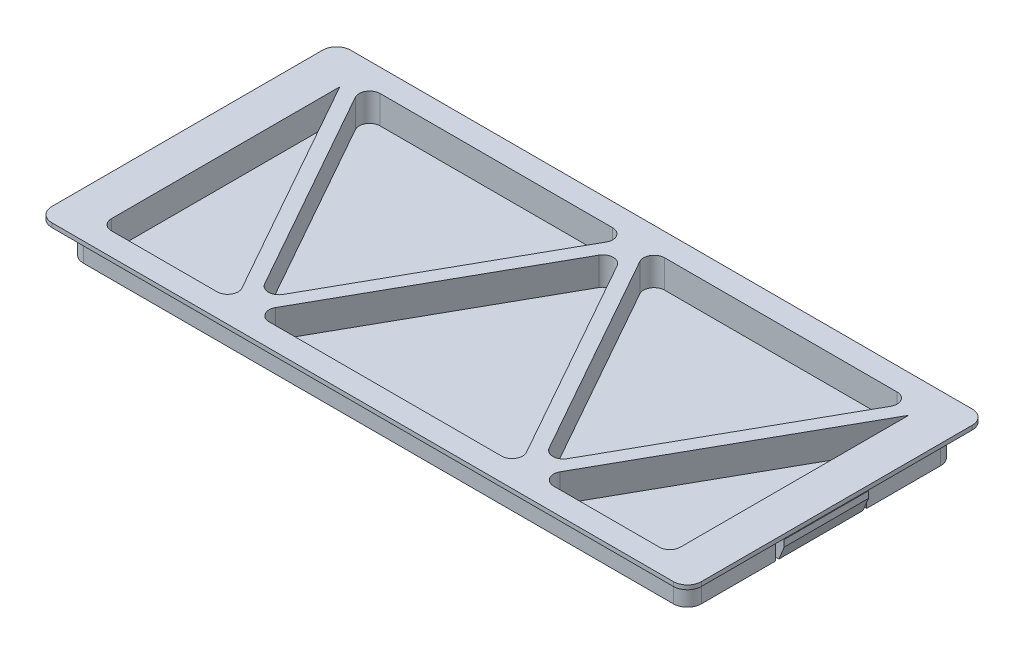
ISO-10303-21;
HEADER;
FILE_DESCRIPTION(('STEP AP214'),'2;1');
FILE_NAME('part.step','',(''),(''),'','','');
FILE_SCHEMA(('AUTOMOTIVE_DESIGN { 1 0 10303 214 1 1 1 1 }'));
ENDSEC;
DATA;
#1=APPLICATION_CONTEXT('core data for automotive mechanical design processes');
#2=APPLICATION_PROTOCOL_DEFINITION('international standard','automotive_design',2000,#1);
#3=PRODUCT_CONTEXT('',#1,'mechanical');
#4=PRODUCT('Part','Part','',(#3));
#5=PRODUCT_RELATED_PRODUCT_CATEGORY('part','',(#4));
#6=PRODUCT_DEFINITION_FORMATION('','',#4);
#7=PRODUCT_DEFINITION_CONTEXT('part definition',#1,'design');
#8=PRODUCT_DEFINITION('design','',#6,#7);
#9=PRODUCT_DEFINITION_SHAPE('','',#8);
#10=(LENGTH_UNIT() NAMED_UNIT(*) SI_UNIT(.MILLI.,.METRE.));
#11=(NAMED_UNIT(*) PLANE_ANGLE_UNIT() SI_UNIT($,.RADIAN.));
#12=(NAMED_UNIT(*) SI_UNIT($,.STERADIAN.) SOLID_ANGLE_UNIT());
#13=UNCERTAINTY_MEASURE_WITH_UNIT(LENGTH_MEASURE(1.E-05),#10,'distance_accuracy_value','');
#14=(GEOMETRIC_REPRESENTATION_CONTEXT(3) GLOBAL_UNCERTAINTY_ASSIGNED_CONTEXT((#13)) GLOBAL_UNIT_ASSIGNED_CONTEXT((#10,
#11,#12)) REPRESENTATION_CONTEXT('',''));
#15=CARTESIAN_POINT('',(0.,0.,0.));
#16=DIRECTION('',(0.,0.,1.));
#17=DIRECTION('',(1.,0.,0.));
#18=AXIS2_PLACEMENT_3D('',#15,#16,#17);
#19=CARTESIAN_POINT('',(44.05,5.,18.05));
#20=DIRECTION('',(0.,0.,-1.));
#21=DIRECTION('',(-1.,0.,0.));
#22=AXIS2_PLACEMENT_3D('',#19,#20,#21);
#23=PLANE('',#22);
#24=DIRECTION('',(1.,0.,0.));
#25=VECTOR('',#24,1.);
#26=CARTESIAN_POINT('',(44.05,1.,18.05));
#27=LINE('',#26,#25);
#28=CARTESIAN_POINT('',(23.9847598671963,1.,18.05));
#29=VERTEX_POINT('',#28);
#30=CARTESIAN_POINT('',(39.05,1.,18.05));
#31=VERTEX_POINT('',#30);
#32=EDGE_CURVE('E529',#29,#31,#27,.T.);
#33=ORIENTED_EDGE('',*,*,#32,.F.);
#34=DIRECTION('',(0.,-1.,0.));
#35=VECTOR('',#34,1.);
#36=CARTESIAN_POINT('',(23.9847598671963,5.,18.05));
#37=LINE('',#36,#35);
#38=CARTESIAN_POINT('',(23.9847598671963,5.,18.05));
#39=VERTEX_POINT('',#38);
#40=EDGE_CURVE('E727',#29,#39,#37,.F.);
#41=ORIENTED_EDGE('',*,*,#40,.T.);
#42=DIRECTION('',(1.,0.,0.));
#43=VECTOR('',#42,1.);
#44=CARTESIAN_POINT('',(44.05,5.,18.05));
#45=LINE('',#44,#43);
#46=CARTESIAN_POINT('',(39.05,5.,18.05));
#47=VERTEX_POINT('',#46);
#48=EDGE_CURVE('E560',#39,#47,#45,.T.);
#49=ORIENTED_EDGE('',*,*,#48,.T.);
#50=DIRECTION('',(0.,1.,0.));
#51=VECTOR('',#50,1.);
#52=CARTESIAN_POINT('',(39.05,1.,18.05));
#53=LINE('',#52,#51);
#54=EDGE_CURVE('E724',#47,#31,#53,.F.);
#55=ORIENTED_EDGE('',*,*,#54,.T.);
#56=EDGE_LOOP('',(#33,#41,#49,#55));
#57=FACE_BOUND('',#56,.T.);
#58=ADVANCED_FACE('F47',(#57),#23,.T.);
#59=CARTESIAN_POINT('',(-16.5652401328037,5.,18.05));
#60=VERTEX_POINT('',#59);
#61=CARTESIAN_POINT('',(16.5652401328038,5.,18.05));
#62=VERTEX_POINT('',#61);
#63=EDGE_CURVE('E559',#60,#62,#45,.T.);
#64=ORIENTED_EDGE('',*,*,#63,.T.);
#65=DIRECTION('',(0.,1.,0.));
#66=VECTOR('',#65,1.);
#67=CARTESIAN_POINT('',(16.5652401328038,0.999999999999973,18.05));
#68=LINE('',#67,#66);
#69=CARTESIAN_POINT('',(16.5652401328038,1.,18.05));
#70=VERTEX_POINT('',#69);
#71=EDGE_CURVE('E740',#62,#70,#68,.F.);
#72=ORIENTED_EDGE('',*,*,#71,.T.);
#73=CARTESIAN_POINT('',(-16.5652401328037,1.,18.05));
#74=VERTEX_POINT('',#73);
#75=EDGE_CURVE('E549',#74,#70,#27,.T.);
#76=ORIENTED_EDGE('',*,*,#75,.F.);
#77=DIRECTION('',(0.,-1.,0.));
#78=VECTOR('',#77,1.);
#79=CARTESIAN_POINT('',(-16.5652401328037,5.,18.05));
#80=LINE('',#79,#78);
#81=EDGE_CURVE('E737',#74,#60,#80,.F.);
#82=ORIENTED_EDGE('',*,*,#81,.T.);
#83=EDGE_LOOP('',(#64,#72,#76,#82));
#84=FACE_BOUND('',#83,.T.);
#85=ADVANCED_FACE('F868',(#84),#23,.T.);
#86=CARTESIAN_POINT('',(44.05,5.,-18.05));
#87=DIRECTION('',(0.,0.,1.));
#88=DIRECTION('',(1.,0.,0.));
#89=AXIS2_PLACEMENT_3D('',#86,#87,#88);
#90=PLANE('',#89);
#91=DIRECTION('',(-1.,0.,0.));
#92=VECTOR('',#91,1.);
#93=CARTESIAN_POINT('',(44.05,1.,-18.05));
#94=LINE('',#93,#92);
#95=CARTESIAN_POINT('',(-3.70975986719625,1.,-18.05));
#96=VERTEX_POINT('',#95);
#97=CARTESIAN_POINT('',(-36.8402401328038,1.,-18.05));
#98=VERTEX_POINT('',#97);
#99=EDGE_CURVE('E548',#96,#98,#94,.T.);
#100=ORIENTED_EDGE('',*,*,#99,.F.);
#101=DIRECTION('',(0.,-1.,0.));
#102=VECTOR('',#101,1.);
#103=CARTESIAN_POINT('',(-3.70975986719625,5.,-18.05));
#104=LINE('',#103,#102);
#105=CARTESIAN_POINT('',(-3.70975986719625,5.,-18.05));
#106=VERTEX_POINT('',#105);
#107=EDGE_CURVE('E780',#96,#106,#104,.F.);
#108=ORIENTED_EDGE('',*,*,#107,.T.);
#109=DIRECTION('',(-1.,0.,0.));
#110=VECTOR('',#109,1.);
#111=CARTESIAN_POINT('',(44.05,5.,-18.05));
#112=LINE('',#111,#110);
#113=CARTESIAN_POINT('',(-36.8402401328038,5.,-18.05));
#114=VERTEX_POINT('',#113);
#115=EDGE_CURVE('E558',#106,#114,#112,.T.);
#116=ORIENTED_EDGE('',*,*,#115,.T.);
#117=DIRECTION('',(0.,1.,0.));
#118=VECTOR('',#117,1.);
#119=CARTESIAN_POINT('',(-36.8402401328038,0.999999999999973,-18.05));
#120=LINE('',#119,#118);
#121=EDGE_CURVE('E777',#114,#98,#120,.F.);
#122=ORIENTED_EDGE('',*,*,#121,.T.);
#123=EDGE_LOOP('',(#100,#108,#116,#122));
#124=FACE_BOUND('',#123,.T.);
#125=ADVANCED_FACE('F874',(#124),#90,.T.);
#126=CARTESIAN_POINT('',(0.,1.,0.));
#127=DIRECTION('',(0.,1.,0.));
#128=DIRECTION('',(0.,0.,1.));
#129=AXIS2_PLACEMENT_3D('',#126,#127,#128);
#130=PLANE('',#129);
#131=DIRECTION('',(0.489687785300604,0.,-0.871897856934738));
#132=VECTOR('',#131,1.);
#133=CARTESIAN_POINT('',(-20.275,1.,16.0078824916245));
#134=LINE('',#133,#132);
#135=CARTESIAN_POINT('',(-18.9671532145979,1.,13.6792379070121));
#136=VERTEX_POINT('',#135);
#137=CARTESIAN_POINT('',(-2.40191308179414,1.,-15.8154683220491));
#138=VERTEX_POINT('',#137);
#139=EDGE_CURVE('E917',#136,#138,#134,.T.);
#140=ORIENTED_EDGE('',*,*,#139,.T.);
#141=CARTESIAN_POINT('',(-3.70975986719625,1.,-16.55));
#142=DIRECTION('',(0.,1.,0.));
#143=DIRECTION('',(0.,0.,1.));
#144=AXIS2_PLACEMENT_3D('',#141,#142,#143);
#145=CIRCLE('',#144,1.5);
#146=EDGE_CURVE('E774',#138,#96,#145,.T.);
#147=ORIENTED_EDGE('',*,*,#146,.T.);
#148=ORIENTED_EDGE('',*,*,#99,.T.);
#149=CARTESIAN_POINT('',(-36.8402401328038,1.,-16.55));
#150=DIRECTION('',(0.,1.,0.));
#151=DIRECTION('',(0.,0.,1.));
#152=AXIS2_PLACEMENT_3D('',#149,#150,#151);
#153=CIRCLE('',#152,1.5);
#154=CARTESIAN_POINT('',(-38.1480869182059,1.,-15.8154683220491));
#155=VERTEX_POINT('',#154);
#156=EDGE_CURVE('E768',#98,#155,#153,.T.);
#157=ORIENTED_EDGE('',*,*,#156,.T.);
#158=DIRECTION('',(0.489687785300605,0.,0.871897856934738));
#159=VECTOR('',#158,1.);
#160=CARTESIAN_POINT('',(-39.6781021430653,1.,-18.5396877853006));
#161=LINE('',#160,#159);
#162=CARTESIAN_POINT('',(-21.5828467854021,1.,13.6792379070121));
#163=VERTEX_POINT('',#162);
#164=EDGE_CURVE('E910',#155,#163,#161,.T.);
#165=ORIENTED_EDGE('',*,*,#164,.T.);
#166=CARTESIAN_POINT('',(-20.275,1.,12.9447062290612));
#167=DIRECTION('',(0.,1.,0.));
#168=DIRECTION('',(0.,0.,1.));
#169=AXIS2_PLACEMENT_3D('',#166,#167,#168);
#170=CIRCLE('',#169,1.5);
#171=EDGE_CURVE('E771',#163,#136,#170,.T.);
#172=ORIENTED_EDGE('',*,*,#171,.T.);
#173=EDGE_LOOP('',(#140,#147,#148,#157,#165,#172));
#174=FACE_BOUND('',#173,.T.);
#175=ADVANCED_FACE('F1283',(#174),#130,.T.);
#176=DIRECTION('',(0.489687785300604,0.,-0.871897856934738));
#177=VECTOR('',#176,1.);
#178=CARTESIAN_POINT('',(20.275,1.,16.0078824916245));
#179=LINE('',#178,#177);
#180=CARTESIAN_POINT('',(21.5828467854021,1.,13.6792379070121));
#181=VERTEX_POINT('',#180);
#182=CARTESIAN_POINT('',(38.1480869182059,1.,-15.8154683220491));
#183=VERTEX_POINT('',#182);
#184=EDGE_CURVE('E470',#181,#183,#179,.T.);
#185=ORIENTED_EDGE('',*,*,#184,.T.);
#186=CARTESIAN_POINT('',(36.8402401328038,1.,-16.55));
#187=DIRECTION('',(0.,1.,0.));
#188=DIRECTION('',(0.,0.,1.));
#189=AXIS2_PLACEMENT_3D('',#186,#187,#188);
#190=CIRCLE('',#189,1.5);
#191=CARTESIAN_POINT('',(36.8402401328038,1.,-18.05));
#192=VERTEX_POINT('',#191);
#193=EDGE_CURVE('E701',#183,#192,#190,.T.);
#194=ORIENTED_EDGE('',*,*,#193,.T.);
#195=CARTESIAN_POINT('',(3.70975986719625,1.,-18.05));
#196=VERTEX_POINT('',#195);
#197=EDGE_CURVE('E553',#192,#196,#94,.T.);
#198=ORIENTED_EDGE('',*,*,#197,.T.);
#199=CARTESIAN_POINT('',(3.70975986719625,1.,-16.55));
#200=DIRECTION('',(0.,1.,0.));
#201=DIRECTION('',(0.,0.,1.));
#202=AXIS2_PLACEMENT_3D('',#199,#200,#201);
#203=CIRCLE('',#202,1.5);
#204=CARTESIAN_POINT('',(2.40191308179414,1.,-15.8154683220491));
#205=VERTEX_POINT('',#204);
#206=EDGE_CURVE('E695',#196,#205,#203,.T.);
#207=ORIENTED_EDGE('',*,*,#206,.T.);
#208=DIRECTION('',(0.489687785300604,0.,0.871897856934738));
#209=VECTOR('',#208,1.);
#210=CARTESIAN_POINT('',(0.,1.,-20.0921175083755));
#211=LINE('',#210,#209);
#212=CARTESIAN_POINT('',(18.9671532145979,1.,13.6792379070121));
#213=VERTEX_POINT('',#212);
#214=EDGE_CURVE('E1217',#205,#213,#211,.T.);
#215=ORIENTED_EDGE('',*,*,#214,.T.);
#216=CARTESIAN_POINT('',(20.275,1.,12.9447062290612));
#217=DIRECTION('',(0.,1.,0.));
#218=DIRECTION('',(0.,0.,1.));
#219=AXIS2_PLACEMENT_3D('',#216,#217,#218);
#220=CIRCLE('',#219,1.5);
#221=EDGE_CURVE('E698',#213,#181,#220,.T.);
#222=ORIENTED_EDGE('',*,*,#221,.T.);
#223=EDGE_LOOP('',(#185,#194,#198,#207,#215,#222));
#224=FACE_BOUND('',#223,.T.);
#225=ADVANCED_FACE('F1716',(#224),#130,.T.);
#226=DIRECTION('',(-0.489687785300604,0.,0.871897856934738));
#227=VECTOR('',#226,1.);
#228=CARTESIAN_POINT('',(20.275,1.,20.0921175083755));
#229=LINE('',#228,#227);
#230=CARTESIAN_POINT('',(40.55,1.,-16.0078824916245));
#231=VERTEX_POINT('',#230);
#232=CARTESIAN_POINT('',(22.6769130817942,1.,15.8154683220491));
#233=VERTEX_POINT('',#232);
#234=EDGE_CURVE('E460',#231,#233,#229,.T.);
#235=ORIENTED_EDGE('',*,*,#234,.T.);
#236=CARTESIAN_POINT('',(23.9847598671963,1.,16.55));
#237=DIRECTION('',(0.,1.,0.));
#238=DIRECTION('',(0.,0.,1.));
#239=AXIS2_PLACEMENT_3D('',#236,#237,#238);
#240=CIRCLE('',#239,1.5);
#241=EDGE_CURVE('E721',#233,#29,#240,.T.);
#242=ORIENTED_EDGE('',*,*,#241,.T.);
#243=ORIENTED_EDGE('',*,*,#32,.T.);
#244=CARTESIAN_POINT('',(39.05,1.,16.55));
#245=DIRECTION('',(0.,1.,0.));
#246=DIRECTION('',(0.,0.,1.));
#247=AXIS2_PLACEMENT_3D('',#244,#245,#246);
#248=CIRCLE('',#247,1.5);
#249=CARTESIAN_POINT('',(40.55,1.,16.55));
#250=VERTEX_POINT('',#249);
#251=EDGE_CURVE('E487',#31,#250,#248,.T.);
#252=ORIENTED_EDGE('',*,*,#251,.T.);
#253=DIRECTION('',(0.,0.,1.));
#254=VECTOR('',#253,1.);
#255=CARTESIAN_POINT('',(40.55,1.,0.));
#256=LINE('',#255,#254);
#257=EDGE_CURVE('E476',#231,#250,#256,.T.);
#258=ORIENTED_EDGE('',*,*,#257,.F.);
#259=EDGE_LOOP('',(#235,#242,#243,#252,#258));
#260=FACE_BOUND('',#259,.T.);
#261=ADVANCED_FACE('F484',(#260),#130,.T.);
#262=ORIENTED_EDGE('',*,*,#75,.T.);
#263=CARTESIAN_POINT('',(16.5652401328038,1.,16.55));
#264=DIRECTION('',(0.,1.,0.));
#265=DIRECTION('',(0.,0.,1.));
#266=AXIS2_PLACEMENT_3D('',#263,#264,#265);
#267=CIRCLE('',#266,1.5);
#268=CARTESIAN_POINT('',(17.8730869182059,1.,15.8154683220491));
#269=VERTEX_POINT('',#268);
#270=EDGE_CURVE('E749',#70,#269,#267,.T.);
#271=ORIENTED_EDGE('',*,*,#270,.T.);
#272=DIRECTION('',(-0.489687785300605,0.,-0.871897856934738));
#273=VECTOR('',#272,1.);
#274=CARTESIAN_POINT('',(0.,1.,-16.0078824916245));
#275=LINE('',#274,#273);
#276=CARTESIAN_POINT('',(1.30784678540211,1.,-13.6792379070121));
#277=VERTEX_POINT('',#276);
#278=EDGE_CURVE('E471',#269,#277,#275,.T.);
#279=ORIENTED_EDGE('',*,*,#278,.T.);
#280=CARTESIAN_POINT('',(0.,1.,-12.9447062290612));
#281=DIRECTION('',(0.,1.,0.));
#282=DIRECTION('',(0.,0.,1.));
#283=AXIS2_PLACEMENT_3D('',#280,#281,#282);
#284=CIRCLE('',#283,1.5);
#285=CARTESIAN_POINT('',(-1.30784678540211,1.,-13.6792379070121));
#286=VERTEX_POINT('',#285);
#287=EDGE_CURVE('E746',#277,#286,#284,.T.);
#288=ORIENTED_EDGE('',*,*,#287,.T.);
#289=DIRECTION('',(-0.489687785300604,0.,0.871897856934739));
#290=VECTOR('',#289,1.);
#291=CARTESIAN_POINT('',(-20.275,1.,20.0921175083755));
#292=LINE('',#291,#290);
#293=CARTESIAN_POINT('',(-17.8730869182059,1.,15.8154683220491));
#294=VERTEX_POINT('',#293);
#295=EDGE_CURVE('E1203',#286,#294,#292,.T.);
#296=ORIENTED_EDGE('',*,*,#295,.T.);
#297=CARTESIAN_POINT('',(-16.5652401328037,1.,16.55));
#298=DIRECTION('',(0.,1.,0.));
#299=DIRECTION('',(0.,0.,1.));
#300=AXIS2_PLACEMENT_3D('',#297,#298,#299);
#301=CIRCLE('',#300,1.5);
#302=EDGE_CURVE('E743',#294,#74,#301,.T.);
#303=ORIENTED_EDGE('',*,*,#302,.T.);
#304=EDGE_LOOP('',(#262,#271,#279,#288,#296,#303));
#305=FACE_BOUND('',#304,.T.);
#306=ADVANCED_FACE('F1241',(#305),#130,.T.);
#307=CARTESIAN_POINT('',(-44.05,5.,19.05));
#308=DIRECTION('',(1.,0.,0.));
#309=DIRECTION('',(0.,0.,-1.));
#310=AXIS2_PLACEMENT_3D('',#307,#308,#309);
#311=PLANE('',#310);
#312=DIRECTION('',(0.,0.,1.));
#313=VECTOR('',#312,1.);
#314=CARTESIAN_POINT('',(-44.05,0.,19.05));
#315=LINE('',#314,#313);
#316=CARTESIAN_POINT('',(-44.05,0.,6.5));
#317=VERTEX_POINT('',#316);
#318=CARTESIAN_POINT('',(-44.05,0.,17.05));
#319=VERTEX_POINT('',#318);
#320=EDGE_CURVE('E569',#317,#319,#315,.T.);
#321=ORIENTED_EDGE('',*,*,#320,.T.);
#322=DIRECTION('',(0.,-1.,0.));
#323=VECTOR('',#322,1.);
#324=CARTESIAN_POINT('',(-44.05,5.,17.05));
#325=LINE('',#324,#323);
#326=CARTESIAN_POINT('',(-44.05,4.4,17.05));
#327=VERTEX_POINT('',#326);
#328=EDGE_CURVE('E644',#319,#327,#325,.F.);
#329=ORIENTED_EDGE('',*,*,#328,.T.);
#330=DIRECTION('',(0.,0.,1.));
#331=VECTOR('',#330,1.);
#332=CARTESIAN_POINT('',(-44.05,4.4,-19.05));
#333=LINE('',#332,#331);
#334=CARTESIAN_POINT('',(-44.05,4.4,-17.05));
#335=VERTEX_POINT('',#334);
#336=EDGE_CURVE('E494',#335,#327,#333,.T.);
#337=ORIENTED_EDGE('',*,*,#336,.F.);
#338=DIRECTION('',(0.,-1.,0.));
#339=VECTOR('',#338,1.);
#340=CARTESIAN_POINT('',(-44.05,5.,-17.05));
#341=LINE('',#340,#339);
#342=CARTESIAN_POINT('',(-44.05,0.,-17.05));
#343=VERTEX_POINT('',#342);
#344=EDGE_CURVE('E640',#335,#343,#341,.T.);
#345=ORIENTED_EDGE('',*,*,#344,.T.);
#346=CARTESIAN_POINT('',(-44.05,0.,-6.5));
#347=VERTEX_POINT('',#346);
#348=EDGE_CURVE('E565',#343,#347,#315,.T.);
#349=ORIENTED_EDGE('',*,*,#348,.T.);
#350=DIRECTION('',(0.,-1.,0.));
#351=VECTOR('',#350,1.);
#352=CARTESIAN_POINT('',(-44.05,17.4862523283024,-6.5));
#353=LINE('',#352,#351);
#354=CARTESIAN_POINT('',(-44.05,3.9,-6.5));
#355=VERTEX_POINT('',#354);
#356=EDGE_CURVE('E994',#355,#347,#353,.T.);
#357=ORIENTED_EDGE('',*,*,#356,.F.);
#358=DIRECTION('',(0.,0.,1.));
#359=VECTOR('',#358,1.);
#360=CARTESIAN_POINT('',(-44.05,3.9,6.5));
#361=LINE('',#360,#359);
#362=CARTESIAN_POINT('',(-44.05,3.9,-6.));
#363=VERTEX_POINT('',#362);
#364=EDGE_CURVE('E1006',#355,#363,#361,.T.);
#365=ORIENTED_EDGE('',*,*,#364,.T.);
#366=DIRECTION('',(0.,1.,0.));
#367=VECTOR('',#366,1.);
#368=CARTESIAN_POINT('',(-44.05,-12.0104121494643,-6.));
#369=LINE('',#368,#367);
#370=CARTESIAN_POINT('',(-44.05,2.8,-5.99999999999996));
#371=VERTEX_POINT('',#370);
#372=EDGE_CURVE('E955',#371,#363,#369,.T.);
#373=ORIENTED_EDGE('',*,*,#372,.F.);
#374=DIRECTION('',(0.,0.,-1.));
#375=VECTOR('',#374,1.);
#376=CARTESIAN_POINT('',(-44.05,2.8,8.898706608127));
#377=LINE('',#376,#375);
#378=CARTESIAN_POINT('',(-44.05,2.8,6.));
#379=VERTEX_POINT('',#378);
#380=EDGE_CURVE('E940',#379,#371,#377,.T.);
#381=ORIENTED_EDGE('',*,*,#380,.F.);
#382=DIRECTION('',(0.,1.,0.));
#383=VECTOR('',#382,1.);
#384=CARTESIAN_POINT('',(-44.05,-12.0104121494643,6.));
#385=LINE('',#384,#383);
#386=CARTESIAN_POINT('',(-44.05,3.9,6.));
#387=VERTEX_POINT('',#386);
#388=EDGE_CURVE('E974',#379,#387,#385,.T.);
#389=ORIENTED_EDGE('',*,*,#388,.T.);
#390=CARTESIAN_POINT('',(-44.05,3.9,6.5));
#391=VERTEX_POINT('',#390);
#392=EDGE_CURVE('E1011',#387,#391,#361,.T.);
#393=ORIENTED_EDGE('',*,*,#392,.T.);
#394=DIRECTION('',(0.,-1.,0.));
#395=VECTOR('',#394,1.);
#396=CARTESIAN_POINT('',(-44.05,17.4862523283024,6.5));
#397=LINE('',#396,#395);
#398=EDGE_CURVE('E1001',#391,#317,#397,.T.);
#399=ORIENTED_EDGE('',*,*,#398,.T.);
#400=EDGE_LOOP('',(#321,#329,#337,#345,#349,#357,#365,#373,#381,#389,#393,#399));
#401=FACE_BOUND('',#400,.T.);
#402=ADVANCED_FACE('F888',(#401),#311,.F.);
#403=CARTESIAN_POINT('',(0.,0.,0.));
#404=DIRECTION('',(0.,1.,0.));
#405=DIRECTION('',(0.,0.,1.));
#406=AXIS2_PLACEMENT_3D('',#403,#404,#405);
#407=PLANE('',#406);
#408=DIRECTION('',(1.,0.,0.));
#409=VECTOR('',#408,1.);
#410=CARTESIAN_POINT('',(44.05,0.,19.05));
#411=LINE('',#410,#409);
#412=CARTESIAN_POINT('',(-42.05,0.,19.05));
#413=VERTEX_POINT('',#412);
#414=CARTESIAN_POINT('',(42.05,0.,19.05));
#415=VERTEX_POINT('',#414);
#416=EDGE_CURVE('E568',#413,#415,#411,.T.);
#417=ORIENTED_EDGE('',*,*,#416,.F.);
#418=CARTESIAN_POINT('',(-42.05,0.,17.05));
#419=DIRECTION('',(0.,1.,0.));
#420=DIRECTION('',(0.,0.,1.));
#421=AXIS2_PLACEMENT_3D('',#418,#419,#420);
#422=CIRCLE('',#421,2.);
#423=EDGE_CURVE('E637',#413,#319,#422,.F.);
#424=ORIENTED_EDGE('',*,*,#423,.T.);
#425=ORIENTED_EDGE('',*,*,#320,.F.);
#426=DIRECTION('',(1.,0.,0.));
#427=VECTOR('',#426,1.);
#428=CARTESIAN_POINT('',(-42.55,0.,6.5));
#429=LINE('',#428,#427);
#430=CARTESIAN_POINT('',(-42.55,0.,6.5));
#431=VERTEX_POINT('',#430);
#432=EDGE_CURVE('E996',#317,#431,#429,.T.);
#433=ORIENTED_EDGE('',*,*,#432,.T.);
#434=DIRECTION('',(0.,0.,-1.));
#435=VECTOR('',#434,1.);
#436=CARTESIAN_POINT('',(-42.55,0.,6.5));
#437=LINE('',#436,#435);
#438=CARTESIAN_POINT('',(-42.55,0.,-6.5));
#439=VERTEX_POINT('',#438);
#440=EDGE_CURVE('E1002',#431,#439,#437,.T.);
#441=ORIENTED_EDGE('',*,*,#440,.T.);
#442=DIRECTION('',(-1.,0.,0.));
#443=VECTOR('',#442,1.);
#444=CARTESIAN_POINT('',(-42.55,0.,-6.5));
#445=LINE('',#444,#443);
#446=EDGE_CURVE('E990',#439,#347,#445,.T.);
#447=ORIENTED_EDGE('',*,*,#446,.T.);
#448=ORIENTED_EDGE('',*,*,#348,.F.);
#449=CARTESIAN_POINT('',(-42.05,0.,-17.05));
#450=DIRECTION('',(0.,1.,0.));
#451=DIRECTION('',(0.,0.,1.));
#452=AXIS2_PLACEMENT_3D('',#449,#450,#451);
#453=CIRCLE('',#452,2.);
#454=CARTESIAN_POINT('',(-42.05,0.,-19.05));
#455=VERTEX_POINT('',#454);
#456=EDGE_CURVE('E634',#343,#455,#453,.F.);
#457=ORIENTED_EDGE('',*,*,#456,.T.);
#458=DIRECTION('',(-1.,0.,0.));
#459=VECTOR('',#458,1.);
#460=CARTESIAN_POINT('',(44.05,0.,-19.05));
#461=LINE('',#460,#459);
#462=CARTESIAN_POINT('',(42.05,0.,-19.05));
#463=VERTEX_POINT('',#462);
#464=EDGE_CURVE('E577',#463,#455,#461,.T.);
#465=ORIENTED_EDGE('',*,*,#464,.F.);
#466=CARTESIAN_POINT('',(42.05,0.,-17.05));
#467=DIRECTION('',(0.,1.,0.));
#468=DIRECTION('',(0.,0.,1.));
#469=AXIS2_PLACEMENT_3D('',#466,#467,#468);
#470=CIRCLE('',#469,2.);
#471=CARTESIAN_POINT('',(44.05,0.,-17.05));
#472=VERTEX_POINT('',#471);
#473=EDGE_CURVE('E628',#463,#472,#470,.F.);
#474=ORIENTED_EDGE('',*,*,#473,.T.);
#475=DIRECTION('',(0.,0.,-1.));
#476=VECTOR('',#475,1.);
#477=CARTESIAN_POINT('',(44.05,0.,19.05));
#478=LINE('',#477,#476);
#479=CARTESIAN_POINT('',(44.05,0.,-6.5));
#480=VERTEX_POINT('',#479);
#481=EDGE_CURVE('E573',#480,#472,#478,.T.);
#482=ORIENTED_EDGE('',*,*,#481,.F.);
#483=DIRECTION('',(1.,0.,0.));
#484=VECTOR('',#483,1.);
#485=CARTESIAN_POINT('',(42.55,0.,-6.5));
#486=LINE('',#485,#484);
#487=CARTESIAN_POINT('',(42.55,0.,-6.5));
#488=VERTEX_POINT('',#487);
#489=EDGE_CURVE('E1117',#488,#480,#486,.T.);
#490=ORIENTED_EDGE('',*,*,#489,.F.);
#491=DIRECTION('',(0.,0.,-1.));
#492=VECTOR('',#491,1.);
#493=CARTESIAN_POINT('',(42.55,0.,6.5));
#494=LINE('',#493,#492);
#495=CARTESIAN_POINT('',(42.55,0.,6.5));
#496=VERTEX_POINT('',#495);
#497=EDGE_CURVE('E1083',#496,#488,#494,.T.);
#498=ORIENTED_EDGE('',*,*,#497,.F.);
#499=DIRECTION('',(-1.,0.,0.));
#500=VECTOR('',#499,1.);
#501=CARTESIAN_POINT('',(42.55,0.,6.5));
#502=LINE('',#501,#500);
#503=CARTESIAN_POINT('',(44.05,0.,6.5));
#504=VERTEX_POINT('',#503);
#505=EDGE_CURVE('E1112',#504,#496,#502,.T.);
#506=ORIENTED_EDGE('',*,*,#505,.F.);
#507=CARTESIAN_POINT('',(44.05,0.,17.05));
#508=VERTEX_POINT('',#507);
#509=EDGE_CURVE('E574',#508,#504,#478,.T.);
#510=ORIENTED_EDGE('',*,*,#509,.F.);
#511=CARTESIAN_POINT('',(42.05,0.,17.05));
#512=DIRECTION('',(0.,1.,0.));
#513=DIRECTION('',(0.,0.,1.));
#514=AXIS2_PLACEMENT_3D('',#511,#512,#513);
#515=CIRCLE('',#514,2.);
#516=EDGE_CURVE('E631',#508,#415,#515,.F.);
#517=ORIENTED_EDGE('',*,*,#516,.T.);
#518=EDGE_LOOP('',(#417,#424,#425,#433,#441,#447,#448,#457,#465,#474,#482,#490,#498,#506,#510,#517));
#519=FACE_BOUND('',#518,.T.);
#520=ADVANCED_FACE('F880',(#519),#407,.F.);
#521=CARTESIAN_POINT('',(-39.05,5.,18.05));
#522=VERTEX_POINT('',#521);
#523=CARTESIAN_POINT('',(-23.9847598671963,5.,18.05));
#524=VERTEX_POINT('',#523);
#525=EDGE_CURVE('E554',#522,#524,#45,.T.);
#526=ORIENTED_EDGE('',*,*,#525,.T.);
#527=DIRECTION('',(0.,1.,0.));
#528=VECTOR('',#527,1.);
#529=CARTESIAN_POINT('',(-23.9847598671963,1.,18.05));
#530=LINE('',#529,#528);
#531=CARTESIAN_POINT('',(-23.9847598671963,1.,18.05));
#532=VERTEX_POINT('',#531);
#533=EDGE_CURVE('E791',#524,#532,#530,.F.);
#534=ORIENTED_EDGE('',*,*,#533,.T.);
#535=CARTESIAN_POINT('',(-39.05,1.,18.05));
#536=VERTEX_POINT('',#535);
#537=EDGE_CURVE('E544',#536,#532,#27,.T.);
#538=ORIENTED_EDGE('',*,*,#537,.F.);
#539=DIRECTION('',(0.,1.,0.));
#540=VECTOR('',#539,1.);
#541=CARTESIAN_POINT('',(-39.05,5.,18.05));
#542=LINE('',#541,#540);
#543=EDGE_CURVE('E787',#536,#522,#542,.T.);
#544=ORIENTED_EDGE('',*,*,#543,.T.);
#545=EDGE_LOOP('',(#526,#534,#538,#544));
#546=FACE_BOUND('',#545,.T.);
#547=ADVANCED_FACE('F870',(#546),#23,.T.);
#548=ORIENTED_EDGE('',*,*,#197,.F.);
#549=DIRECTION('',(0.,-1.,0.));
#550=VECTOR('',#549,1.);
#551=CARTESIAN_POINT('',(36.8402401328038,5.,-18.05));
#552=LINE('',#551,#550);
#553=CARTESIAN_POINT('',(36.8402401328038,5.,-18.05));
#554=VERTEX_POINT('',#553);
#555=EDGE_CURVE('E707',#192,#554,#552,.F.);
#556=ORIENTED_EDGE('',*,*,#555,.T.);
#557=CARTESIAN_POINT('',(3.70975986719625,5.,-18.05));
#558=VERTEX_POINT('',#557);
#559=EDGE_CURVE('E564',#554,#558,#112,.T.);
#560=ORIENTED_EDGE('',*,*,#559,.T.);
#561=DIRECTION('',(0.,1.,0.));
#562=VECTOR('',#561,1.);
#563=CARTESIAN_POINT('',(3.70975986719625,0.999999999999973,-18.05));
#564=LINE('',#563,#562);
#565=EDGE_CURVE('E704',#558,#196,#564,.F.);
#566=ORIENTED_EDGE('',*,*,#565,.T.);
#567=EDGE_LOOP('',(#548,#556,#560,#566));
#568=FACE_BOUND('',#567,.T.);
#569=ADVANCED_FACE('F879',(#568),#90,.T.);
#570=ORIENTED_EDGE('',*,*,#537,.T.);
#571=CARTESIAN_POINT('',(-23.9847598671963,1.,16.55));
#572=DIRECTION('',(0.,1.,0.));
#573=DIRECTION('',(0.,0.,1.));
#574=AXIS2_PLACEMENT_3D('',#571,#572,#573);
#575=CIRCLE('',#574,1.5);
#576=CARTESIAN_POINT('',(-22.6769130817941,1.,15.8154683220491));
#577=VERTEX_POINT('',#576);
#578=EDGE_CURVE('E797',#532,#577,#575,.T.);
#579=ORIENTED_EDGE('',*,*,#578,.T.);
#580=DIRECTION('',(-0.489687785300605,0.,-0.871897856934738));
#581=VECTOR('',#580,1.);
#582=CARTESIAN_POINT('',(-41.4218978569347,1.,-17.5603122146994));
#583=LINE('',#582,#581);
#584=CARTESIAN_POINT('',(-40.55,1.,-16.0078824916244));
#585=VERTEX_POINT('',#584);
#586=EDGE_CURVE('E901',#577,#585,#583,.T.);
#587=ORIENTED_EDGE('',*,*,#586,.T.);
#588=DIRECTION('',(0.,0.,1.));
#589=VECTOR('',#588,1.);
#590=CARTESIAN_POINT('',(-40.55,1.,0.));
#591=LINE('',#590,#589);
#592=CARTESIAN_POINT('',(-40.55,1.,16.55));
#593=VERTEX_POINT('',#592);
#594=EDGE_CURVE('E1035',#585,#593,#591,.T.);
#595=ORIENTED_EDGE('',*,*,#594,.T.);
#596=CARTESIAN_POINT('',(-39.05,1.,16.55));
#597=DIRECTION('',(0.,1.,0.));
#598=DIRECTION('',(0.,0.,1.));
#599=AXIS2_PLACEMENT_3D('',#596,#597,#598);
#600=CIRCLE('',#599,1.5);
#601=EDGE_CURVE('E794',#593,#536,#600,.T.);
#602=ORIENTED_EDGE('',*,*,#601,.T.);
#603=EDGE_LOOP('',(#570,#579,#587,#595,#602));
#604=FACE_BOUND('',#603,.T.);
#605=ADVANCED_FACE('F886',(#604),#130,.T.);
#606=CARTESIAN_POINT('',(0.,3.9,0.));
#607=DIRECTION('',(0.,1.,0.));
#608=DIRECTION('',(0.,0.,1.));
#609=AXIS2_PLACEMENT_3D('',#606,#607,#608);
#610=PLANE('',#609);
#611=DIRECTION('',(1.,0.,0.));
#612=VECTOR('',#611,1.);
#613=CARTESIAN_POINT('',(44.05,3.9,-6.));
#614=LINE('',#613,#612);
#615=CARTESIAN_POINT('',(43.55,3.9,-6.));
#616=VERTEX_POINT('',#615);
#617=CARTESIAN_POINT('',(44.05,3.9,-6.));
#618=VERTEX_POINT('',#617);
#619=EDGE_CURVE('E1091',#616,#618,#614,.T.);
#620=ORIENTED_EDGE('',*,*,#619,.F.);
#621=DIRECTION('',(0.,0.,-1.));
#622=VECTOR('',#621,1.);
#623=CARTESIAN_POINT('',(43.55,3.9,6.));
#624=LINE('',#623,#622);
#625=CARTESIAN_POINT('',(43.55,3.9,6.));
#626=VERTEX_POINT('',#625);
#627=EDGE_CURVE('E1087',#626,#616,#624,.T.);
#628=ORIENTED_EDGE('',*,*,#627,.F.);
#629=DIRECTION('',(-1.,0.,0.));
#630=VECTOR('',#629,1.);
#631=CARTESIAN_POINT('',(44.05,3.9,6.));
#632=LINE('',#631,#630);
#633=CARTESIAN_POINT('',(44.05,3.9,6.));
#634=VERTEX_POINT('',#633);
#635=EDGE_CURVE('E1069',#634,#626,#632,.T.);
#636=ORIENTED_EDGE('',*,*,#635,.F.);
#637=DIRECTION('',(0.,0.,1.));
#638=VECTOR('',#637,1.);
#639=CARTESIAN_POINT('',(44.05,3.9,6.5));
#640=LINE('',#639,#638);
#641=CARTESIAN_POINT('',(44.05,3.9,6.5));
#642=VERTEX_POINT('',#641);
#643=EDGE_CURVE('E1141',#634,#642,#640,.T.);
#644=ORIENTED_EDGE('',*,*,#643,.T.);
#645=DIRECTION('',(-1.,0.,0.));
#646=VECTOR('',#645,1.);
#647=CARTESIAN_POINT('',(42.55,3.9,6.5));
#648=LINE('',#647,#646);
#649=CARTESIAN_POINT('',(42.55,3.9,6.5));
#650=VERTEX_POINT('',#649);
#651=EDGE_CURVE('E1132',#642,#650,#648,.T.);
#652=ORIENTED_EDGE('',*,*,#651,.T.);
#653=DIRECTION('',(0.,0.,-1.));
#654=VECTOR('',#653,1.);
#655=CARTESIAN_POINT('',(42.55,3.9,6.5));
#656=LINE('',#655,#654);
#657=CARTESIAN_POINT('',(42.55,3.9,-6.5));
#658=VERTEX_POINT('',#657);
#659=EDGE_CURVE('E1127',#650,#658,#656,.T.);
#660=ORIENTED_EDGE('',*,*,#659,.T.);
#661=DIRECTION('',(1.,0.,0.));
#662=VECTOR('',#661,1.);
#663=CARTESIAN_POINT('',(42.55,3.9,-6.5));
#664=LINE('',#663,#662);
#665=CARTESIAN_POINT('',(44.05,3.9,-6.5));
#666=VERTEX_POINT('',#665);
#667=EDGE_CURVE('E1116',#658,#666,#664,.T.);
#668=ORIENTED_EDGE('',*,*,#667,.T.);
#669=EDGE_CURVE('E1137',#666,#618,#640,.T.);
#670=ORIENTED_EDGE('',*,*,#669,.T.);
#671=EDGE_LOOP('',(#620,#628,#636,#644,#652,#660,#668,#670));
#672=FACE_BOUND('',#671,.T.);
#673=ADVANCED_FACE('F1410',(#672),#610,.F.);
#674=CARTESIAN_POINT('',(0.,5.,0.));
#675=DIRECTION('',(0.,1.,0.));
#676=DIRECTION('',(0.,0.,1.));
#677=AXIS2_PLACEMENT_3D('',#674,#675,#676);
#678=PLANE('',#677);
#679=DIRECTION('',(0.489687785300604,0.,-0.871897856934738));
#680=VECTOR('',#679,1.);
#681=CARTESIAN_POINT('',(-20.275,5.,20.0921175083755));
#682=LINE('',#681,#680);
#683=CARTESIAN_POINT('',(-17.8730869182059,5.,15.8154683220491));
#684=VERTEX_POINT('',#683);
#685=CARTESIAN_POINT('',(-1.30784678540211,5.,-13.6792379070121));
#686=VERTEX_POINT('',#685);
#687=EDGE_CURVE('E1190',#684,#686,#682,.T.);
#688=ORIENTED_EDGE('',*,*,#687,.T.);
#689=CARTESIAN_POINT('',(0.,5.,-12.9447062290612));
#690=DIRECTION('',(0.,1.,0.));
#691=DIRECTION('',(0.,0.,1.));
#692=AXIS2_PLACEMENT_3D('',#689,#690,#691);
#693=CIRCLE('',#692,1.5);
#694=CARTESIAN_POINT('',(1.30784678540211,5.,-13.6792379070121));
#695=VERTEX_POINT('',#694);
#696=EDGE_CURVE('E825',#686,#695,#693,.F.);
#697=ORIENTED_EDGE('',*,*,#696,.T.);
#698=DIRECTION('',(0.489687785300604,0.,0.871897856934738));
#699=VECTOR('',#698,1.);
#700=CARTESIAN_POINT('',(0.,5.,-16.0078824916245));
#701=LINE('',#700,#699);
#702=CARTESIAN_POINT('',(17.8730869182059,5.,15.8154683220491));
#703=VERTEX_POINT('',#702);
#704=EDGE_CURVE('E1182',#695,#703,#701,.T.);
#705=ORIENTED_EDGE('',*,*,#704,.T.);
#706=CARTESIAN_POINT('',(16.5652401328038,5.,16.55));
#707=DIRECTION('',(0.,1.,0.));
#708=DIRECTION('',(0.,0.,1.));
#709=AXIS2_PLACEMENT_3D('',#706,#707,#708);
#710=CIRCLE('',#709,1.5);
#711=EDGE_CURVE('E822',#703,#62,#710,.F.);
#712=ORIENTED_EDGE('',*,*,#711,.T.);
#713=ORIENTED_EDGE('',*,*,#63,.F.);
#714=CARTESIAN_POINT('',(-16.5652401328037,5.,16.55));
#715=DIRECTION('',(0.,1.,0.));
#716=DIRECTION('',(0.,0.,1.));
#717=AXIS2_PLACEMENT_3D('',#714,#715,#716);
#718=CIRCLE('',#717,1.5);
#719=EDGE_CURVE('E834',#60,#684,#718,.F.);
#720=ORIENTED_EDGE('',*,*,#719,.T.);
#721=EDGE_LOOP('',(#688,#697,#705,#712,#713,#720));
#722=FACE_BOUND('',#721,.T.);
#723=DIRECTION('',(0.489687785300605,0.,0.871897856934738));
#724=VECTOR('',#723,1.);
#725=CARTESIAN_POINT('',(-41.4218978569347,5.,-17.5603122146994));
#726=LINE('',#725,#724);
#727=CARTESIAN_POINT('',(-40.55,5.,-16.0078824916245));
#728=VERTEX_POINT('',#727);
#729=CARTESIAN_POINT('',(-22.6769130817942,5.,15.8154683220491));
#730=VERTEX_POINT('',#729);
#731=EDGE_CURVE('E1224',#728,#730,#726,.T.);
#732=ORIENTED_EDGE('',*,*,#731,.T.);
#733=CARTESIAN_POINT('',(-23.9847598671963,5.,16.55));
#734=DIRECTION('',(0.,1.,0.));
#735=DIRECTION('',(0.,0.,1.));
#736=AXIS2_PLACEMENT_3D('',#733,#734,#735);
#737=CIRCLE('',#736,1.5);
#738=EDGE_CURVE('E837',#730,#524,#737,.F.);
#739=ORIENTED_EDGE('',*,*,#738,.T.);
#740=ORIENTED_EDGE('',*,*,#525,.F.);
#741=CARTESIAN_POINT('',(-39.05,5.,16.55));
#742=DIRECTION('',(0.,1.,0.));
#743=DIRECTION('',(0.,0.,1.));
#744=AXIS2_PLACEMENT_3D('',#741,#742,#743);
#745=CIRCLE('',#744,1.5);
#746=CARTESIAN_POINT('',(-40.55,5.,16.55));
#747=VERTEX_POINT('',#746);
#748=EDGE_CURVE('E13',#522,#747,#745,.F.);
#749=ORIENTED_EDGE('',*,*,#748,.T.);
#750=DIRECTION('',(0.,0.,-1.));
#751=VECTOR('',#750,1.);
#752=CARTESIAN_POINT('',(-40.55,5.,19.05));
#753=LINE('',#752,#751);
#754=EDGE_CURVE('E1010',#747,#728,#753,.T.);
#755=ORIENTED_EDGE('',*,*,#754,.T.);
#756=EDGE_LOOP('',(#732,#739,#740,#749,#755));
#757=FACE_BOUND('',#756,.T.);
#758=DIRECTION('',(-0.489687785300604,0.,0.871897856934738));
#759=VECTOR('',#758,1.);
#760=CARTESIAN_POINT('',(-20.275,5.,16.0078824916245));
#761=LINE('',#760,#759);
#762=CARTESIAN_POINT('',(-2.40191308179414,5.,-15.8154683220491));
#763=VERTEX_POINT('',#762);
#764=CARTESIAN_POINT('',(-18.9671532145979,5.,13.6792379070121));
#765=VERTEX_POINT('',#764);
#766=EDGE_CURVE('E1196',#763,#765,#761,.T.);
#767=ORIENTED_EDGE('',*,*,#766,.T.);
#768=CARTESIAN_POINT('',(-20.275,5.,12.9447062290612));
#769=DIRECTION('',(0.,1.,0.));
#770=DIRECTION('',(0.,0.,1.));
#771=AXIS2_PLACEMENT_3D('',#768,#769,#770);
#772=CIRCLE('',#771,1.5);
#773=CARTESIAN_POINT('',(-21.5828467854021,5.,13.6792379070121));
#774=VERTEX_POINT('',#773);
#775=EDGE_CURVE('E840',#765,#774,#772,.F.);
#776=ORIENTED_EDGE('',*,*,#775,.T.);
#777=DIRECTION('',(-0.489687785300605,0.,-0.871897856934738));
#778=VECTOR('',#777,1.);
#779=CARTESIAN_POINT('',(-39.6781021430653,5.,-18.5396877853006));
#780=LINE('',#779,#778);
#781=CARTESIAN_POINT('',(-38.1480869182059,5.,-15.8154683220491));
#782=VERTEX_POINT('',#781);
#783=EDGE_CURVE('E921',#774,#782,#780,.T.);
#784=ORIENTED_EDGE('',*,*,#783,.T.);
#785=CARTESIAN_POINT('',(-36.8402401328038,5.,-16.55));
#786=DIRECTION('',(0.,1.,0.));
#787=DIRECTION('',(0.,0.,1.));
#788=AXIS2_PLACEMENT_3D('',#785,#786,#787);
#789=CIRCLE('',#788,1.5);
#790=EDGE_CURVE('E843',#782,#114,#789,.F.);
#791=ORIENTED_EDGE('',*,*,#790,.T.);
#792=ORIENTED_EDGE('',*,*,#115,.F.);
#793=CARTESIAN_POINT('',(-3.70975986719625,5.,-16.55));
#794=DIRECTION('',(0.,1.,0.));
#795=DIRECTION('',(0.,0.,1.));
#796=AXIS2_PLACEMENT_3D('',#793,#794,#795);
#797=CIRCLE('',#796,1.5);
#798=EDGE_CURVE('E831',#106,#763,#797,.F.);
#799=ORIENTED_EDGE('',*,*,#798,.T.);
#800=EDGE_LOOP('',(#767,#776,#784,#791,#792,#799));
#801=FACE_BOUND('',#800,.T.);
#802=DIRECTION('',(-0.489687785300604,0.,0.871897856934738));
#803=VECTOR('',#802,1.);
#804=CARTESIAN_POINT('',(20.275,5.,16.0078824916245));
#805=LINE('',#804,#803);
#806=CARTESIAN_POINT('',(38.1480869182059,5.,-15.8154683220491));
#807=VERTEX_POINT('',#806);
#808=CARTESIAN_POINT('',(21.5828467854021,5.,13.6792379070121));
#809=VERTEX_POINT('',#808);
#810=EDGE_CURVE('E1181',#807,#809,#805,.T.);
#811=ORIENTED_EDGE('',*,*,#810,.T.);
#812=CARTESIAN_POINT('',(20.275,5.,12.9447062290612));
#813=DIRECTION('',(0.,1.,0.));
#814=DIRECTION('',(0.,0.,1.));
#815=AXIS2_PLACEMENT_3D('',#812,#813,#814);
#816=CIRCLE('',#815,1.5);
#817=CARTESIAN_POINT('',(18.9671532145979,5.,13.6792379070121));
#818=VERTEX_POINT('',#817);
#819=EDGE_CURVE('E816',#809,#818,#816,.F.);
#820=ORIENTED_EDGE('',*,*,#819,.T.);
#821=DIRECTION('',(-0.489687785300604,0.,-0.871897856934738));
#822=VECTOR('',#821,1.);
#823=CARTESIAN_POINT('',(0.,5.,-20.0921175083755));
#824=LINE('',#823,#822);
#825=CARTESIAN_POINT('',(2.40191308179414,5.,-15.8154683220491));
#826=VERTEX_POINT('',#825);
#827=EDGE_CURVE('E1187',#818,#826,#824,.T.);
#828=ORIENTED_EDGE('',*,*,#827,.T.);
#829=CARTESIAN_POINT('',(3.70975986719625,5.,-16.55));
#830=DIRECTION('',(0.,1.,0.));
#831=DIRECTION('',(0.,0.,1.));
#832=AXIS2_PLACEMENT_3D('',#829,#830,#831);
#833=CIRCLE('',#832,1.5);
#834=EDGE_CURVE('E828',#826,#558,#833,.F.);
#835=ORIENTED_EDGE('',*,*,#834,.T.);
#836=ORIENTED_EDGE('',*,*,#559,.F.);
#837=CARTESIAN_POINT('',(36.8402401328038,5.,-16.55));
#838=DIRECTION('',(0.,1.,0.));
#839=DIRECTION('',(0.,0.,1.));
#840=AXIS2_PLACEMENT_3D('',#837,#838,#839);
#841=CIRCLE('',#840,1.5);
#842=EDGE_CURVE('E813',#554,#807,#841,.F.);
#843=ORIENTED_EDGE('',*,*,#842,.T.);
#844=EDGE_LOOP('',(#811,#820,#828,#835,#836,#843));
#845=FACE_BOUND('',#844,.T.);
#846=ORIENTED_EDGE('',*,*,#48,.F.);
#847=CARTESIAN_POINT('',(23.9847598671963,5.,16.55));
#848=DIRECTION('',(0.,1.,0.));
#849=DIRECTION('',(0.,0.,1.));
#850=AXIS2_PLACEMENT_3D('',#847,#848,#849);
#851=CIRCLE('',#850,1.5);
#852=CARTESIAN_POINT('',(22.6769130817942,5.,15.8154683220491));
#853=VERTEX_POINT('',#852);
#854=EDGE_CURVE('E819',#39,#853,#851,.F.);
#855=ORIENTED_EDGE('',*,*,#854,.T.);
#856=DIRECTION('',(0.489687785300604,0.,-0.871897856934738));
#857=VECTOR('',#856,1.);
#858=CARTESIAN_POINT('',(20.275,5.,20.0921175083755));
#859=LINE('',#858,#857);
#860=CARTESIAN_POINT('',(40.55,5.,-16.0078824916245));
#861=VERTEX_POINT('',#860);
#862=EDGE_CURVE('E1179',#853,#861,#859,.T.);
#863=ORIENTED_EDGE('',*,*,#862,.T.);
#864=DIRECTION('',(0.,0.,-1.));
#865=VECTOR('',#864,1.);
#866=CARTESIAN_POINT('',(40.55,5.,19.05));
#867=LINE('',#866,#865);
#868=CARTESIAN_POINT('',(40.55,5.,16.55));
#869=VERTEX_POINT('',#868);
#870=EDGE_CURVE('E478',#869,#861,#867,.T.);
#871=ORIENTED_EDGE('',*,*,#870,.F.);
#872=CARTESIAN_POINT('',(39.05,5.,16.55));
#873=DIRECTION('',(0.,1.,0.));
#874=DIRECTION('',(0.,0.,1.));
#875=AXIS2_PLACEMENT_3D('',#872,#873,#874);
#876=CIRCLE('',#875,1.5);
#877=EDGE_CURVE('E56',#869,#47,#876,.F.);
#878=ORIENTED_EDGE('',*,*,#877,.T.);
#879=EDGE_LOOP('',(#846,#855,#863,#871,#878));
#880=FACE_BOUND('',#879,.T.);
#881=DIRECTION('',(0.,0.,1.));
#882=VECTOR('',#881,1.);
#883=CARTESIAN_POINT('',(-46.3,5.,-21.3));
#884=LINE('',#883,#882);
#885=CARTESIAN_POINT('',(-46.3,5.,-19.3));
#886=VERTEX_POINT('',#885);
#887=CARTESIAN_POINT('',(-46.3,5.,19.3));
#888=VERTEX_POINT('',#887);
#889=EDGE_CURVE('E533',#886,#888,#884,.T.);
#890=ORIENTED_EDGE('',*,*,#889,.T.);
#891=CARTESIAN_POINT('',(-44.3,5.,19.3));
#892=DIRECTION('',(0.,1.,0.));
#893=DIRECTION('',(0.,0.,1.));
#894=AXIS2_PLACEMENT_3D('',#891,#892,#893);
#895=CIRCLE('',#894,2.);
#896=CARTESIAN_POINT('',(-44.3,5.,21.3));
#897=VERTEX_POINT('',#896);
#898=EDGE_CURVE('E599',#888,#897,#895,.T.);
#899=ORIENTED_EDGE('',*,*,#898,.T.);
#900=DIRECTION('',(1.,0.,0.));
#901=VECTOR('',#900,1.);
#902=CARTESIAN_POINT('',(-46.3,5.,21.3));
#903=LINE('',#902,#901);
#904=CARTESIAN_POINT('',(44.3,5.,21.3));
#905=VERTEX_POINT('',#904);
#906=EDGE_CURVE('E537',#897,#905,#903,.T.);
#907=ORIENTED_EDGE('',*,*,#906,.T.);
#908=CARTESIAN_POINT('',(44.3,5.,19.3));
#909=DIRECTION('',(0.,1.,0.));
#910=DIRECTION('',(0.,0.,1.));
#911=AXIS2_PLACEMENT_3D('',#908,#909,#910);
#912=CIRCLE('',#911,2.);
#913=CARTESIAN_POINT('',(46.3,5.,19.3));
#914=VERTEX_POINT('',#913);
#915=EDGE_CURVE('E596',#905,#914,#912,.T.);
#916=ORIENTED_EDGE('',*,*,#915,.T.);
#917=DIRECTION('',(0.,0.,-1.));
#918=VECTOR('',#917,1.);
#919=CARTESIAN_POINT('',(46.3,5.,21.3));
#920=LINE('',#919,#918);
#921=CARTESIAN_POINT('',(46.3,5.,-19.3));
#922=VERTEX_POINT('',#921);
#923=EDGE_CURVE('E517',#914,#922,#920,.T.);
#924=ORIENTED_EDGE('',*,*,#923,.T.);
#925=CARTESIAN_POINT('',(44.3,5.,-19.3));
#926=DIRECTION('',(0.,1.,0.));
#927=DIRECTION('',(0.,0.,1.));
#928=AXIS2_PLACEMENT_3D('',#925,#926,#927);
#929=CIRCLE('',#928,2.);
#930=CARTESIAN_POINT('',(44.3,5.,-21.3));
#931=VERTEX_POINT('',#930);
#932=EDGE_CURVE('E593',#922,#931,#929,.T.);
#933=ORIENTED_EDGE('',*,*,#932,.T.);
#934=DIRECTION('',(-1.,0.,0.));
#935=VECTOR('',#934,1.);
#936=CARTESIAN_POINT('',(46.3,5.,-21.3));
#937=LINE('',#936,#935);
#938=CARTESIAN_POINT('',(-44.3,5.,-21.3));
#939=VERTEX_POINT('',#938);
#940=EDGE_CURVE('E511',#931,#939,#937,.T.);
#941=ORIENTED_EDGE('',*,*,#940,.T.);
#942=CARTESIAN_POINT('',(-44.3,5.,-19.3));
#943=DIRECTION('',(0.,1.,0.));
#944=DIRECTION('',(0.,0.,1.));
#945=AXIS2_PLACEMENT_3D('',#942,#943,#944);
#946=CIRCLE('',#945,2.);
#947=EDGE_CURVE('E590',#939,#886,#946,.T.);
#948=ORIENTED_EDGE('',*,*,#947,.T.);
#949=EDGE_LOOP('',(#890,#899,#907,#916,#924,#933,#941,#948));
#950=FACE_BOUND('',#949,.T.);
#951=ADVANCED_FACE('F849',(#722,#757,#801,#845,#880,#950),#678,.T.);
#952=CARTESIAN_POINT('',(46.3,4.4,-21.3));
#953=DIRECTION('',(0.,0.,-1.));
#954=DIRECTION('',(-1.,0.,0.));
#955=AXIS2_PLACEMENT_3D('',#952,#953,#954);
#956=PLANE('',#955);
#957=ORIENTED_EDGE('',*,*,#940,.F.);
#958=DIRECTION('',(0.,1.,0.));
#959=VECTOR('',#958,1.);
#960=CARTESIAN_POINT('',(44.3,4.4,-21.3));
#961=LINE('',#960,#959);
#962=CARTESIAN_POINT('',(44.3,4.4,-21.3));
#963=VERTEX_POINT('',#962);
#964=EDGE_CURVE('E672',#931,#963,#961,.F.);
#965=ORIENTED_EDGE('',*,*,#964,.T.);
#966=DIRECTION('',(-1.,0.,0.));
#967=VECTOR('',#966,1.);
#968=CARTESIAN_POINT('',(46.3,4.4,-21.3));
#969=LINE('',#968,#967);
#970=CARTESIAN_POINT('',(-44.3,4.4,-21.3));
#971=VERTEX_POINT('',#970);
#972=EDGE_CURVE('E512',#963,#971,#969,.T.);
#973=ORIENTED_EDGE('',*,*,#972,.T.);
#974=DIRECTION('',(0.,1.,0.));
#975=VECTOR('',#974,1.);
#976=CARTESIAN_POINT('',(-44.3,4.4,-21.3));
#977=LINE('',#976,#975);
#978=EDGE_CURVE('E668',#971,#939,#977,.T.);
#979=ORIENTED_EDGE('',*,*,#978,.T.);
#980=EDGE_LOOP('',(#957,#965,#973,#979));
#981=FACE_BOUND('',#980,.T.);
#982=ADVANCED_FACE('F1427',(#981),#956,.T.);
#983=CARTESIAN_POINT('',(46.3,4.4,21.3));
#984=DIRECTION('',(1.,0.,0.));
#985=DIRECTION('',(0.,0.,-1.));
#986=AXIS2_PLACEMENT_3D('',#983,#984,#985);
#987=PLANE('',#986);
#988=ORIENTED_EDGE('',*,*,#923,.F.);
#989=DIRECTION('',(0.,1.,0.));
#990=VECTOR('',#989,1.);
#991=CARTESIAN_POINT('',(46.3,4.4,19.3));
#992=LINE('',#991,#990);
#993=CARTESIAN_POINT('',(46.3,4.4,19.3));
#994=VERTEX_POINT('',#993);
#995=EDGE_CURVE('E665',#914,#994,#992,.F.);
#996=ORIENTED_EDGE('',*,*,#995,.T.);
#997=DIRECTION('',(0.,0.,-1.));
#998=VECTOR('',#997,1.);
#999=CARTESIAN_POINT('',(46.3,4.4,21.3));
#1000=LINE('',#999,#998);
#1001=CARTESIAN_POINT('',(46.3,4.4,-19.3));
#1002=VERTEX_POINT('',#1001);
#1003=EDGE_CURVE('E525',#994,#1002,#1000,.T.);
#1004=ORIENTED_EDGE('',*,*,#1003,.T.);
#1005=DIRECTION('',(0.,1.,0.));
#1006=VECTOR('',#1005,1.);
#1007=CARTESIAN_POINT('',(46.3,4.4,-19.3));
#1008=LINE('',#1007,#1006);
#1009=EDGE_CURVE('E661',#1002,#922,#1008,.T.);
#1010=ORIENTED_EDGE('',*,*,#1009,.T.);
#1011=EDGE_LOOP('',(#988,#996,#1004,#1010));
#1012=FACE_BOUND('',#1011,.T.);
#1013=ADVANCED_FACE('F1423',(#1012),#987,.T.);
#1014=CARTESIAN_POINT('',(-46.3,4.4,21.3));
#1015=DIRECTION('',(0.,0.,1.));
#1016=DIRECTION('',(1.,0.,0.));
#1017=AXIS2_PLACEMENT_3D('',#1014,#1015,#1016);
#1018=PLANE('',#1017);
#1019=ORIENTED_EDGE('',*,*,#906,.F.);
#1020=DIRECTION('',(0.,1.,0.));
#1021=VECTOR('',#1020,1.);
#1022=CARTESIAN_POINT('',(-44.3,4.4,21.3));
#1023=LINE('',#1022,#1021);
#1024=CARTESIAN_POINT('',(-44.3,4.4,21.3));
#1025=VERTEX_POINT('',#1024);
#1026=EDGE_CURVE('E606',#897,#1025,#1023,.F.);
#1027=ORIENTED_EDGE('',*,*,#1026,.T.);
#1028=DIRECTION('',(1.,0.,0.));
#1029=VECTOR('',#1028,1.);
#1030=CARTESIAN_POINT('',(-46.3,4.4,21.3));
#1031=LINE('',#1030,#1029);
#1032=CARTESIAN_POINT('',(44.3,4.4,21.3));
#1033=VERTEX_POINT('',#1032);
#1034=EDGE_CURVE('E521',#1025,#1033,#1031,.T.);
#1035=ORIENTED_EDGE('',*,*,#1034,.T.);
#1036=DIRECTION('',(0.,1.,0.));
#1037=VECTOR('',#1036,1.);
#1038=CARTESIAN_POINT('',(44.3,4.4,21.3));
#1039=LINE('',#1038,#1037);
#1040=EDGE_CURVE('E602',#1033,#905,#1039,.T.);
#1041=ORIENTED_EDGE('',*,*,#1040,.T.);
#1042=EDGE_LOOP('',(#1019,#1027,#1035,#1041));
#1043=FACE_BOUND('',#1042,.T.);
#1044=ADVANCED_FACE('F1426',(#1043),#1018,.T.);
#1045=CARTESIAN_POINT('',(-46.3,4.4,-21.3));
#1046=DIRECTION('',(-1.,0.,0.));
#1047=DIRECTION('',(0.,0.,1.));
#1048=AXIS2_PLACEMENT_3D('',#1045,#1046,#1047);
#1049=PLANE('',#1048);
#1050=DIRECTION('',(0.,0.,1.));
#1051=VECTOR('',#1050,1.);
#1052=CARTESIAN_POINT('',(-46.3,4.4,-21.3));
#1053=LINE('',#1052,#1051);
#1054=CARTESIAN_POINT('',(-46.3,4.4,-19.3));
#1055=VERTEX_POINT('',#1054);
#1056=CARTESIAN_POINT('',(-46.3,4.4,19.3));
#1057=VERTEX_POINT('',#1056);
#1058=EDGE_CURVE('E516',#1055,#1057,#1053,.T.);
#1059=ORIENTED_EDGE('',*,*,#1058,.T.);
#1060=DIRECTION('',(0.,1.,0.));
#1061=VECTOR('',#1060,1.);
#1062=CARTESIAN_POINT('',(-46.3,4.4,19.3));
#1063=LINE('',#1062,#1061);
#1064=EDGE_CURVE('E586',#1057,#888,#1063,.T.);
#1065=ORIENTED_EDGE('',*,*,#1064,.T.);
#1066=ORIENTED_EDGE('',*,*,#889,.F.);
#1067=DIRECTION('',(0.,1.,0.));
#1068=VECTOR('',#1067,1.);
#1069=CARTESIAN_POINT('',(-46.3,4.4,-19.3));
#1070=LINE('',#1069,#1068);
#1071=EDGE_CURVE('E481',#886,#1055,#1070,.F.);
#1072=ORIENTED_EDGE('',*,*,#1071,.T.);
#1073=EDGE_LOOP('',(#1059,#1065,#1066,#1072));
#1074=FACE_BOUND('',#1073,.T.);
#1075=ADVANCED_FACE('F1421',(#1074),#1049,.T.);
#1076=CARTESIAN_POINT('',(0.,4.4,0.));
#1077=DIRECTION('',(0.,1.,0.));
#1078=DIRECTION('',(0.,0.,1.));
#1079=AXIS2_PLACEMENT_3D('',#1076,#1077,#1078);
#1080=PLANE('',#1079);
#1081=ORIENTED_EDGE('',*,*,#336,.T.);
#1082=CARTESIAN_POINT('',(-42.05,4.4,17.05));
#1083=DIRECTION('',(0.,1.,0.));
#1084=DIRECTION('',(0.,0.,1.));
#1085=AXIS2_PLACEMENT_3D('',#1082,#1083,#1084);
#1086=CIRCLE('',#1085,2.);
#1087=CARTESIAN_POINT('',(-42.05,4.4,19.05));
#1088=VERTEX_POINT('',#1087);
#1089=EDGE_CURVE('E675',#327,#1088,#1086,.T.);
#1090=ORIENTED_EDGE('',*,*,#1089,.T.);
#1091=DIRECTION('',(1.,0.,0.));
#1092=VECTOR('',#1091,1.);
#1093=CARTESIAN_POINT('',(-44.05,4.4,19.05));
#1094=LINE('',#1093,#1092);
#1095=CARTESIAN_POINT('',(42.05,4.4,19.05));
#1096=VERTEX_POINT('',#1095);
#1097=EDGE_CURVE('E503',#1088,#1096,#1094,.T.);
#1098=ORIENTED_EDGE('',*,*,#1097,.T.);
#1099=CARTESIAN_POINT('',(42.05,4.4,17.05));
#1100=DIRECTION('',(0.,1.,0.));
#1101=DIRECTION('',(0.,0.,1.));
#1102=AXIS2_PLACEMENT_3D('',#1099,#1100,#1101);
#1103=CIRCLE('',#1102,2.);
#1104=CARTESIAN_POINT('',(44.05,4.4,17.05));
#1105=VERTEX_POINT('',#1104);
#1106=EDGE_CURVE('E681',#1096,#1105,#1103,.T.);
#1107=ORIENTED_EDGE('',*,*,#1106,.T.);
#1108=DIRECTION('',(0.,0.,-1.));
#1109=VECTOR('',#1108,1.);
#1110=CARTESIAN_POINT('',(44.05,4.4,19.05));
#1111=LINE('',#1110,#1109);
#1112=CARTESIAN_POINT('',(44.05,4.4,-17.05));
#1113=VERTEX_POINT('',#1112);
#1114=EDGE_CURVE('E507',#1105,#1113,#1111,.T.);
#1115=ORIENTED_EDGE('',*,*,#1114,.T.);
#1116=CARTESIAN_POINT('',(42.05,4.4,-17.05));
#1117=DIRECTION('',(0.,1.,0.));
#1118=DIRECTION('',(0.,0.,1.));
#1119=AXIS2_PLACEMENT_3D('',#1116,#1117,#1118);
#1120=CIRCLE('',#1119,2.);
#1121=CARTESIAN_POINT('',(42.05,4.4,-19.05));
#1122=VERTEX_POINT('',#1121);
#1123=EDGE_CURVE('E684',#1113,#1122,#1120,.T.);
#1124=ORIENTED_EDGE('',*,*,#1123,.T.);
#1125=DIRECTION('',(-1.,0.,0.));
#1126=VECTOR('',#1125,1.);
#1127=CARTESIAN_POINT('',(44.05,4.4,-19.05));
#1128=LINE('',#1127,#1126);
#1129=CARTESIAN_POINT('',(-42.05,4.4,-19.05));
#1130=VERTEX_POINT('',#1129);
#1131=EDGE_CURVE('E489',#1122,#1130,#1128,.T.);
#1132=ORIENTED_EDGE('',*,*,#1131,.T.);
#1133=CARTESIAN_POINT('',(-42.05,4.4,-17.05));
#1134=DIRECTION('',(0.,1.,0.));
#1135=DIRECTION('',(0.,0.,1.));
#1136=AXIS2_PLACEMENT_3D('',#1133,#1134,#1135);
#1137=CIRCLE('',#1136,2.);
#1138=EDGE_CURVE('E678',#1130,#335,#1137,.T.);
#1139=ORIENTED_EDGE('',*,*,#1138,.T.);
#1140=EDGE_LOOP('',(#1081,#1090,#1098,#1107,#1115,#1124,#1132,#1139));
#1141=FACE_BOUND('',#1140,.T.);
#1142=ORIENTED_EDGE('',*,*,#1034,.F.);
#1143=CARTESIAN_POINT('',(-44.3,4.4,19.3));
#1144=DIRECTION('',(0.,1.,0.));
#1145=DIRECTION('',(0.,0.,1.));
#1146=AXIS2_PLACEMENT_3D('',#1143,#1144,#1145);
#1147=CIRCLE('',#1146,2.);
#1148=EDGE_CURVE('E618',#1025,#1057,#1147,.F.);
#1149=ORIENTED_EDGE('',*,*,#1148,.T.);
#1150=ORIENTED_EDGE('',*,*,#1058,.F.);
#1151=CARTESIAN_POINT('',(-44.3,4.4,-19.3));
#1152=DIRECTION('',(0.,1.,0.));
#1153=DIRECTION('',(0.,0.,1.));
#1154=AXIS2_PLACEMENT_3D('',#1151,#1152,#1153);
#1155=CIRCLE('',#1154,2.);
#1156=EDGE_CURVE('E609',#1055,#971,#1155,.F.);
#1157=ORIENTED_EDGE('',*,*,#1156,.T.);
#1158=ORIENTED_EDGE('',*,*,#972,.F.);
#1159=CARTESIAN_POINT('',(44.3,4.4,-19.3));
#1160=DIRECTION('',(0.,1.,0.));
#1161=DIRECTION('',(0.,0.,1.));
#1162=AXIS2_PLACEMENT_3D('',#1159,#1160,#1161);
#1163=CIRCLE('',#1162,2.);
#1164=EDGE_CURVE('E612',#963,#1002,#1163,.F.);
#1165=ORIENTED_EDGE('',*,*,#1164,.T.);
#1166=ORIENTED_EDGE('',*,*,#1003,.F.);
#1167=CARTESIAN_POINT('',(44.3,4.4,19.3));
#1168=DIRECTION('',(0.,1.,0.));
#1169=DIRECTION('',(0.,0.,1.));
#1170=AXIS2_PLACEMENT_3D('',#1167,#1168,#1169);
#1171=CIRCLE('',#1170,2.);
#1172=EDGE_CURVE('E615',#994,#1033,#1171,.F.);
#1173=ORIENTED_EDGE('',*,*,#1172,.T.);
#1174=EDGE_LOOP('',(#1142,#1149,#1150,#1157,#1158,#1165,#1166,#1173));
#1175=FACE_BOUND('',#1174,.T.);
#1176=ADVANCED_FACE('F1417',(#1141,#1175),#1080,.F.);
#1177=CARTESIAN_POINT('',(44.05,5.,-19.05));
#1178=DIRECTION('',(0.,0.,1.));
#1179=DIRECTION('',(1.,0.,0.));
#1180=AXIS2_PLACEMENT_3D('',#1177,#1178,#1179);
#1181=PLANE('',#1180);
#1182=ORIENTED_EDGE('',*,*,#464,.T.);
#1183=DIRECTION('',(0.,-1.,0.));
#1184=VECTOR('',#1183,1.);
#1185=CARTESIAN_POINT('',(-42.05,5.,-19.05));
#1186=LINE('',#1185,#1184);
#1187=EDGE_CURVE('E651',#455,#1130,#1186,.F.);
#1188=ORIENTED_EDGE('',*,*,#1187,.T.);
#1189=ORIENTED_EDGE('',*,*,#1131,.F.);
#1190=DIRECTION('',(0.,-1.,0.));
#1191=VECTOR('',#1190,1.);
#1192=CARTESIAN_POINT('',(42.05,5.,-19.05));
#1193=LINE('',#1192,#1191);
#1194=EDGE_CURVE('E647',#1122,#463,#1193,.T.);
#1195=ORIENTED_EDGE('',*,*,#1194,.T.);
#1196=EDGE_LOOP('',(#1182,#1188,#1189,#1195));
#1197=FACE_BOUND('',#1196,.T.);
#1198=ADVANCED_FACE('F1420',(#1197),#1181,.F.);
#1199=CARTESIAN_POINT('',(44.05,5.,19.05));
#1200=DIRECTION('',(-1.,0.,0.));
#1201=DIRECTION('',(0.,0.,1.));
#1202=AXIS2_PLACEMENT_3D('',#1199,#1200,#1201);
#1203=PLANE('',#1202);
#1204=ORIENTED_EDGE('',*,*,#1114,.F.);
#1205=DIRECTION('',(0.,-1.,0.));
#1206=VECTOR('',#1205,1.);
#1207=CARTESIAN_POINT('',(44.05,5.,17.05));
#1208=LINE('',#1207,#1206);
#1209=EDGE_CURVE('E657',#1105,#508,#1208,.T.);
#1210=ORIENTED_EDGE('',*,*,#1209,.T.);
#1211=ORIENTED_EDGE('',*,*,#509,.T.);
#1212=DIRECTION('',(0.,-1.,0.));
#1213=VECTOR('',#1212,1.);
#1214=CARTESIAN_POINT('',(44.05,17.4862523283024,6.5));
#1215=LINE('',#1214,#1213);
#1216=EDGE_CURVE('E1136',#642,#504,#1215,.T.);
#1217=ORIENTED_EDGE('',*,*,#1216,.F.);
#1218=ORIENTED_EDGE('',*,*,#643,.F.);
#1219=DIRECTION('',(0.,1.,0.));
#1220=VECTOR('',#1219,1.);
#1221=CARTESIAN_POINT('',(44.05,-12.0104121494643,6.));
#1222=LINE('',#1221,#1220);
#1223=CARTESIAN_POINT('',(44.05,2.8,6.));
#1224=VERTEX_POINT('',#1223);
#1225=EDGE_CURVE('E1106',#1224,#634,#1222,.T.);
#1226=ORIENTED_EDGE('',*,*,#1225,.F.);
#1227=DIRECTION('',(0.,0.,-1.));
#1228=VECTOR('',#1227,1.);
#1229=CARTESIAN_POINT('',(44.05,2.8,8.89870660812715));
#1230=LINE('',#1229,#1228);
#1231=CARTESIAN_POINT('',(44.05,2.8,-6.));
#1232=VERTEX_POINT('',#1231);
#1233=EDGE_CURVE('E1058',#1224,#1232,#1230,.T.);
#1234=ORIENTED_EDGE('',*,*,#1233,.T.);
#1235=DIRECTION('',(0.,1.,0.));
#1236=VECTOR('',#1235,1.);
#1237=CARTESIAN_POINT('',(44.05,-12.0104121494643,-6.));
#1238=LINE('',#1237,#1236);
#1239=EDGE_CURVE('E1095',#1232,#618,#1238,.T.);
#1240=ORIENTED_EDGE('',*,*,#1239,.T.);
#1241=ORIENTED_EDGE('',*,*,#669,.F.);
#1242=DIRECTION('',(0.,-1.,0.));
#1243=VECTOR('',#1242,1.);
#1244=CARTESIAN_POINT('',(44.05,17.4862523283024,-6.5));
#1245=LINE('',#1244,#1243);
#1246=EDGE_CURVE('E1126',#666,#480,#1245,.T.);
#1247=ORIENTED_EDGE('',*,*,#1246,.T.);
#1248=ORIENTED_EDGE('',*,*,#481,.T.);
#1249=DIRECTION('',(0.,-1.,0.));
#1250=VECTOR('',#1249,1.);
#1251=CARTESIAN_POINT('',(44.05,5.,-17.05));
#1252=LINE('',#1251,#1250);
#1253=EDGE_CURVE('E654',#472,#1113,#1252,.F.);
#1254=ORIENTED_EDGE('',*,*,#1253,.T.);
#1255=EDGE_LOOP('',(#1204,#1210,#1211,#1217,#1218,#1226,#1234,#1240,#1241,#1247,#1248,#1254));
#1256=FACE_BOUND('',#1255,.T.);
#1257=ADVANCED_FACE('F1965',(#1256),#1203,.F.);
#1258=CARTESIAN_POINT('',(44.05,5.,19.05));
#1259=DIRECTION('',(0.,0.,-1.));
#1260=DIRECTION('',(-1.,0.,0.));
#1261=AXIS2_PLACEMENT_3D('',#1258,#1259,#1260);
#1262=PLANE('',#1261);
#1263=ORIENTED_EDGE('',*,*,#1097,.F.);
#1264=DIRECTION('',(0.,-1.,0.));
#1265=VECTOR('',#1264,1.);
#1266=CARTESIAN_POINT('',(-42.05,5.,19.05));
#1267=LINE('',#1266,#1265);
#1268=EDGE_CURVE('E624',#1088,#413,#1267,.T.);
#1269=ORIENTED_EDGE('',*,*,#1268,.T.);
#1270=ORIENTED_EDGE('',*,*,#416,.T.);
#1271=DIRECTION('',(0.,-1.,0.));
#1272=VECTOR('',#1271,1.);
#1273=CARTESIAN_POINT('',(42.05,5.,19.05));
#1274=LINE('',#1273,#1272);
#1275=EDGE_CURVE('E621',#415,#1096,#1274,.F.);
#1276=ORIENTED_EDGE('',*,*,#1275,.T.);
#1277=EDGE_LOOP('',(#1263,#1269,#1270,#1276));
#1278=FACE_BOUND('',#1277,.T.);
#1279=ADVANCED_FACE('F1416',(#1278),#1262,.F.);
#1280=CARTESIAN_POINT('',(40.55,43.2604234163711,19.05));
#1281=DIRECTION('',(-1.,0.,0.));
#1282=DIRECTION('',(0.,0.,1.));
#1283=AXIS2_PLACEMENT_3D('',#1280,#1281,#1282);
#1284=PLANE('',#1283);
#1285=ORIENTED_EDGE('',*,*,#257,.T.);
#1286=DIRECTION('',(0.,1.,0.));
#1287=VECTOR('',#1286,1.);
#1288=CARTESIAN_POINT('',(40.55,5.,16.55));
#1289=LINE('',#1288,#1287);
#1290=EDGE_CURVE('E807',#250,#869,#1289,.T.);
#1291=ORIENTED_EDGE('',*,*,#1290,.T.);
#1292=ORIENTED_EDGE('',*,*,#870,.T.);
#1293=DIRECTION('',(0.,1.,0.));
#1294=VECTOR('',#1293,1.);
#1295=CARTESIAN_POINT('',(40.55,43.2604234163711,-16.0078824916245));
#1296=LINE('',#1295,#1294);
#1297=EDGE_CURVE('E464',#231,#861,#1296,.T.);
#1298=ORIENTED_EDGE('',*,*,#1297,.F.);
#1299=EDGE_LOOP('',(#1285,#1291,#1292,#1298));
#1300=FACE_BOUND('',#1299,.T.);
#1301=ADVANCED_FACE('F475',(#1300),#1284,.T.);
#1302=CARTESIAN_POINT('',(42.55,17.4862523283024,-6.5));
#1303=DIRECTION('',(0.,0.,-1.));
#1304=DIRECTION('',(-1.,0.,0.));
#1305=AXIS2_PLACEMENT_3D('',#1302,#1303,#1304);
#1306=PLANE('',#1305);
#1307=DIRECTION('',(0.,-1.,0.));
#1308=VECTOR('',#1307,1.);
#1309=CARTESIAN_POINT('',(42.55,17.4862523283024,-6.5));
#1310=LINE('',#1309,#1308);
#1311=EDGE_CURVE('E496',#658,#488,#1310,.T.);
#1312=ORIENTED_EDGE('',*,*,#1311,.T.);
#1313=ORIENTED_EDGE('',*,*,#489,.T.);
#1314=ORIENTED_EDGE('',*,*,#1246,.F.);
#1315=ORIENTED_EDGE('',*,*,#667,.F.);
#1316=EDGE_LOOP('',(#1312,#1313,#1314,#1315));
#1317=FACE_BOUND('',#1316,.T.);
#1318=ADVANCED_FACE('F1152',(#1317),#1306,.F.);
#1319=CARTESIAN_POINT('',(42.55,17.4862523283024,6.5));
#1320=DIRECTION('',(0.,0.,1.));
#1321=DIRECTION('',(1.,0.,0.));
#1322=AXIS2_PLACEMENT_3D('',#1319,#1320,#1321);
#1323=PLANE('',#1322);
#1324=ORIENTED_EDGE('',*,*,#1216,.T.);
#1325=ORIENTED_EDGE('',*,*,#505,.T.);
#1326=DIRECTION('',(0.,-1.,0.));
#1327=VECTOR('',#1326,1.);
#1328=CARTESIAN_POINT('',(42.55,17.4862523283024,6.5));
#1329=LINE('',#1328,#1327);
#1330=EDGE_CURVE('E1131',#650,#496,#1329,.T.);
#1331=ORIENTED_EDGE('',*,*,#1330,.F.);
#1332=ORIENTED_EDGE('',*,*,#651,.F.);
#1333=EDGE_LOOP('',(#1324,#1325,#1331,#1332));
#1334=FACE_BOUND('',#1333,.T.);
#1335=ADVANCED_FACE('F1404',(#1334),#1323,.F.);
#1336=CARTESIAN_POINT('',(42.55,17.4862523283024,6.5));
#1337=DIRECTION('',(-1.,0.,0.));
#1338=DIRECTION('',(0.,0.,1.));
#1339=AXIS2_PLACEMENT_3D('',#1336,#1337,#1338);
#1340=PLANE('',#1339);
#1341=ORIENTED_EDGE('',*,*,#1330,.T.);
#1342=ORIENTED_EDGE('',*,*,#497,.T.);
#1343=ORIENTED_EDGE('',*,*,#1311,.F.);
#1344=ORIENTED_EDGE('',*,*,#659,.F.);
#1345=EDGE_LOOP('',(#1341,#1342,#1343,#1344));
#1346=FACE_BOUND('',#1345,.T.);
#1347=ADVANCED_FACE('F1156',(#1346),#1340,.F.);
#1348=CARTESIAN_POINT('',(44.05,-12.0104121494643,-6.));
#1349=DIRECTION('',(0.,0.,1.));
#1350=DIRECTION('',(1.,0.,0.));
#1351=AXIS2_PLACEMENT_3D('',#1348,#1349,#1350);
#1352=PLANE('',#1351);
#1353=ORIENTED_EDGE('',*,*,#1239,.F.);
#1354=DIRECTION('',(1.,0.,0.));
#1355=VECTOR('',#1354,1.);
#1356=CARTESIAN_POINT('',(44.05,2.8,-5.99999999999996));
#1357=LINE('',#1356,#1355);
#1358=CARTESIAN_POINT('',(44.8,2.8,-5.99999999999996));
#1359=VERTEX_POINT('',#1358);
#1360=EDGE_CURVE('E1038',#1232,#1359,#1357,.T.);
#1361=ORIENTED_EDGE('',*,*,#1360,.T.);
#1362=DIRECTION('',(0.,-1.,0.));
#1363=VECTOR('',#1362,1.);
#1364=CARTESIAN_POINT('',(44.8,1.85631514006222,-5.99999999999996));
#1365=LINE('',#1364,#1363);
#1366=CARTESIAN_POINT('',(44.8,1.85631514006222,-5.99999999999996));
#1367=VERTEX_POINT('',#1366);
#1368=EDGE_CURVE('E1050',#1359,#1367,#1365,.T.);
#1369=ORIENTED_EDGE('',*,*,#1368,.T.);
#1370=DIRECTION('',(-0.374606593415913,-0.927183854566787,0.));
#1371=VECTOR('',#1370,1.);
#1372=CARTESIAN_POINT('',(44.05,0.,-5.99999999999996));
#1373=LINE('',#1372,#1371);
#1374=CARTESIAN_POINT('',(44.05,0.,-5.99999999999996));
#1375=VERTEX_POINT('',#1374);
#1376=EDGE_CURVE('E1054',#1367,#1375,#1373,.T.);
#1377=ORIENTED_EDGE('',*,*,#1376,.T.);
#1378=DIRECTION('',(-1.,0.,0.));
#1379=VECTOR('',#1378,1.);
#1380=CARTESIAN_POINT('',(44.05,0.,-6.));
#1381=LINE('',#1380,#1379);
#1382=CARTESIAN_POINT('',(43.55,0.,-6.));
#1383=VERTEX_POINT('',#1382);
#1384=EDGE_CURVE('E1075',#1375,#1383,#1381,.T.);
#1385=ORIENTED_EDGE('',*,*,#1384,.T.);
#1386=DIRECTION('',(0.,1.,0.));
#1387=VECTOR('',#1386,1.);
#1388=CARTESIAN_POINT('',(43.55,-12.0104121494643,-6.));
#1389=LINE('',#1388,#1387);
#1390=EDGE_CURVE('E1098',#1383,#616,#1389,.T.);
#1391=ORIENTED_EDGE('',*,*,#1390,.T.);
#1392=ORIENTED_EDGE('',*,*,#619,.T.);
#1393=EDGE_LOOP('',(#1353,#1361,#1369,#1377,#1385,#1391,#1392));
#1394=FACE_BOUND('',#1393,.T.);
#1395=ADVANCED_FACE('F1391',(#1394),#1352,.F.);
#1396=CARTESIAN_POINT('',(43.55,-12.0104121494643,6.));
#1397=DIRECTION('',(1.,0.,0.));
#1398=DIRECTION('',(0.,0.,-1.));
#1399=AXIS2_PLACEMENT_3D('',#1396,#1397,#1398);
#1400=PLANE('',#1399);
#1401=ORIENTED_EDGE('',*,*,#1390,.F.);
#1402=DIRECTION('',(0.,0.,1.));
#1403=VECTOR('',#1402,1.);
#1404=CARTESIAN_POINT('',(43.55,0.,6.));
#1405=LINE('',#1404,#1403);
#1406=CARTESIAN_POINT('',(43.55,0.,6.));
#1407=VERTEX_POINT('',#1406);
#1408=EDGE_CURVE('E1070',#1383,#1407,#1405,.T.);
#1409=ORIENTED_EDGE('',*,*,#1408,.T.);
#1410=DIRECTION('',(0.,1.,0.));
#1411=VECTOR('',#1410,1.);
#1412=CARTESIAN_POINT('',(43.55,-12.0104121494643,6.));
#1413=LINE('',#1412,#1411);
#1414=EDGE_CURVE('E1102',#1407,#626,#1413,.T.);
#1415=ORIENTED_EDGE('',*,*,#1414,.T.);
#1416=ORIENTED_EDGE('',*,*,#627,.T.);
#1417=EDGE_LOOP('',(#1401,#1409,#1415,#1416));
#1418=FACE_BOUND('',#1417,.T.);
#1419=ADVANCED_FACE('F1394',(#1418),#1400,.F.);
#1420=CARTESIAN_POINT('',(44.05,-12.0104121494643,6.));
#1421=DIRECTION('',(0.,0.,-1.));
#1422=DIRECTION('',(-1.,0.,0.));
#1423=AXIS2_PLACEMENT_3D('',#1420,#1421,#1422);
#1424=PLANE('',#1423);
#1425=ORIENTED_EDGE('',*,*,#1414,.F.);
#1426=DIRECTION('',(1.,0.,0.));
#1427=VECTOR('',#1426,1.);
#1428=CARTESIAN_POINT('',(44.05,0.,6.));
#1429=LINE('',#1428,#1427);
#1430=CARTESIAN_POINT('',(44.05,0.,6.));
#1431=VERTEX_POINT('',#1430);
#1432=EDGE_CURVE('E1074',#1407,#1431,#1429,.T.);
#1433=ORIENTED_EDGE('',*,*,#1432,.T.);
#1434=DIRECTION('',(0.374606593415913,0.927183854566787,0.));
#1435=VECTOR('',#1434,1.);
#1436=CARTESIAN_POINT('',(44.05,0.,6.));
#1437=LINE('',#1436,#1435);
#1438=CARTESIAN_POINT('',(44.8,1.85631514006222,6.));
#1439=VERTEX_POINT('',#1438);
#1440=EDGE_CURVE('E1042',#1431,#1439,#1437,.T.);
#1441=ORIENTED_EDGE('',*,*,#1440,.T.);
#1442=DIRECTION('',(0.,1.,0.));
#1443=VECTOR('',#1442,1.);
#1444=CARTESIAN_POINT('',(44.8,1.85631514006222,6.));
#1445=LINE('',#1444,#1443);
#1446=CARTESIAN_POINT('',(44.8,2.8,6.));
#1447=VERTEX_POINT('',#1446);
#1448=EDGE_CURVE('E1039',#1439,#1447,#1445,.T.);
#1449=ORIENTED_EDGE('',*,*,#1448,.T.);
#1450=DIRECTION('',(-1.,0.,0.));
#1451=VECTOR('',#1450,1.);
#1452=CARTESIAN_POINT('',(44.05,2.8,6.));
#1453=LINE('',#1452,#1451);
#1454=EDGE_CURVE('E1046',#1447,#1224,#1453,.T.);
#1455=ORIENTED_EDGE('',*,*,#1454,.T.);
#1456=ORIENTED_EDGE('',*,*,#1225,.T.);
#1457=ORIENTED_EDGE('',*,*,#635,.T.);
#1458=EDGE_LOOP('',(#1425,#1433,#1441,#1449,#1455,#1456,#1457));
#1459=FACE_BOUND('',#1458,.T.);
#1460=ADVANCED_FACE('F1389',(#1459),#1424,.F.);
#1461=CARTESIAN_POINT('',(0.,0.,0.));
#1462=DIRECTION('',(0.,1.,0.));
#1463=DIRECTION('',(0.,0.,1.));
#1464=AXIS2_PLACEMENT_3D('',#1461,#1462,#1463);
#1465=PLANE('',#1464);
#1466=ORIENTED_EDGE('',*,*,#1432,.F.);
#1467=ORIENTED_EDGE('',*,*,#1408,.F.);
#1468=ORIENTED_EDGE('',*,*,#1384,.F.);
#1469=DIRECTION('',(0.,0.,-1.));
#1470=VECTOR('',#1469,1.);
#1471=CARTESIAN_POINT('',(44.05,0.,6.));
#1472=LINE('',#1471,#1470);
#1473=EDGE_CURVE('E1079',#1431,#1375,#1472,.T.);
#1474=ORIENTED_EDGE('',*,*,#1473,.F.);
#1475=EDGE_LOOP('',(#1466,#1467,#1468,#1474));
#1476=FACE_BOUND('',#1475,.T.);
#1477=ADVANCED_FACE('F1379',(#1476),#1465,.F.);
#1478=CARTESIAN_POINT('',(44.05,0.,8.89870660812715));
#1479=DIRECTION('',(0.927183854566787,-0.374606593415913,0.));
#1480=DIRECTION('',(0.374606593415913,0.927183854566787,0.));
#1481=AXIS2_PLACEMENT_3D('',#1478,#1479,#1480);
#1482=PLANE('',#1481);
#1483=ORIENTED_EDGE('',*,*,#1440,.F.);
#1484=ORIENTED_EDGE('',*,*,#1473,.T.);
#1485=ORIENTED_EDGE('',*,*,#1376,.F.);
#1486=DIRECTION('',(0.,0.,-1.));
#1487=VECTOR('',#1486,1.);
#1488=CARTESIAN_POINT('',(44.8,1.85631514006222,8.89870660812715));
#1489=LINE('',#1488,#1487);
#1490=EDGE_CURVE('E1043',#1439,#1367,#1489,.T.);
#1491=ORIENTED_EDGE('',*,*,#1490,.F.);
#1492=EDGE_LOOP('',(#1483,#1484,#1485,#1491));
#1493=FACE_BOUND('',#1492,.T.);
#1494=ADVANCED_FACE('F1375',(#1493),#1482,.T.);
#1495=CARTESIAN_POINT('',(44.8,1.85631514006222,8.89870660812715));
#1496=DIRECTION('',(1.,0.,0.));
#1497=DIRECTION('',(0.,0.,-1.));
#1498=AXIS2_PLACEMENT_3D('',#1495,#1496,#1497);
#1499=PLANE('',#1498);
#1500=ORIENTED_EDGE('',*,*,#1448,.F.);
#1501=ORIENTED_EDGE('',*,*,#1490,.T.);
#1502=ORIENTED_EDGE('',*,*,#1368,.F.);
#1503=DIRECTION('',(0.,0.,-1.));
#1504=VECTOR('',#1503,1.);
#1505=CARTESIAN_POINT('',(44.8,2.8,8.89870660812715));
#1506=LINE('',#1505,#1504);
#1507=EDGE_CURVE('E1061',#1447,#1359,#1506,.T.);
#1508=ORIENTED_EDGE('',*,*,#1507,.F.);
#1509=EDGE_LOOP('',(#1500,#1501,#1502,#1508));
#1510=FACE_BOUND('',#1509,.T.);
#1511=ADVANCED_FACE('F1378',(#1510),#1499,.T.);
#1512=CARTESIAN_POINT('',(44.05,2.8,8.89870660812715));
#1513=DIRECTION('',(0.,1.,0.));
#1514=DIRECTION('',(0.,0.,1.));
#1515=AXIS2_PLACEMENT_3D('',#1512,#1513,#1514);
#1516=PLANE('',#1515);
#1517=ORIENTED_EDGE('',*,*,#1454,.F.);
#1518=ORIENTED_EDGE('',*,*,#1507,.T.);
#1519=ORIENTED_EDGE('',*,*,#1360,.F.);
#1520=ORIENTED_EDGE('',*,*,#1233,.F.);
#1521=EDGE_LOOP('',(#1517,#1518,#1519,#1520));
#1522=FACE_BOUND('',#1521,.T.);
#1523=ADVANCED_FACE('F1373',(#1522),#1516,.T.);
#1524=CARTESIAN_POINT('',(-40.55,43.2604234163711,19.05));
#1525=DIRECTION('',(-1.,0.,0.));
#1526=DIRECTION('',(0.,0.,1.));
#1527=AXIS2_PLACEMENT_3D('',#1524,#1525,#1526);
#1528=PLANE('',#1527);
#1529=ORIENTED_EDGE('',*,*,#754,.F.);
#1530=DIRECTION('',(0.,1.,0.));
#1531=VECTOR('',#1530,1.);
#1532=CARTESIAN_POINT('',(-40.55,43.2604234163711,16.55));
#1533=LINE('',#1532,#1531);
#1534=EDGE_CURVE('E810',#747,#593,#1533,.F.);
#1535=ORIENTED_EDGE('',*,*,#1534,.T.);
#1536=ORIENTED_EDGE('',*,*,#594,.F.);
#1537=DIRECTION('',(0.,1.,0.));
#1538=VECTOR('',#1537,1.);
#1539=CARTESIAN_POINT('',(-40.55,43.2604234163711,-16.0078824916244));
#1540=LINE('',#1539,#1538);
#1541=EDGE_CURVE('E482',#585,#728,#1540,.T.);
#1542=ORIENTED_EDGE('',*,*,#1541,.T.);
#1543=EDGE_LOOP('',(#1529,#1535,#1536,#1542));
#1544=FACE_BOUND('',#1543,.T.);
#1545=ADVANCED_FACE('F1366',(#1544),#1528,.F.);
#1546=CARTESIAN_POINT('',(-42.55,17.4862523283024,6.5));
#1547=DIRECTION('',(-1.,0.,0.));
#1548=DIRECTION('',(0.,0.,1.));
#1549=AXIS2_PLACEMENT_3D('',#1546,#1547,#1548);
#1550=PLANE('',#1549);
#1551=DIRECTION('',(0.,0.,-1.));
#1552=VECTOR('',#1551,1.);
#1553=CARTESIAN_POINT('',(-42.55,3.9,6.5));
#1554=LINE('',#1553,#1552);
#1555=CARTESIAN_POINT('',(-42.55,3.9,6.5));
#1556=VERTEX_POINT('',#1555);
#1557=CARTESIAN_POINT('',(-42.55,3.9,-6.5));
#1558=VERTEX_POINT('',#1557);
#1559=EDGE_CURVE('E1016',#1556,#1558,#1554,.T.);
#1560=ORIENTED_EDGE('',*,*,#1559,.T.);
#1561=DIRECTION('',(0.,-1.,0.));
#1562=VECTOR('',#1561,1.);
#1563=CARTESIAN_POINT('',(-42.55,17.4862523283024,-6.5));
#1564=LINE('',#1563,#1562);
#1565=EDGE_CURVE('E995',#1558,#439,#1564,.T.);
#1566=ORIENTED_EDGE('',*,*,#1565,.T.);
#1567=ORIENTED_EDGE('',*,*,#440,.F.);
#1568=DIRECTION('',(0.,-1.,0.));
#1569=VECTOR('',#1568,1.);
#1570=CARTESIAN_POINT('',(-42.55,17.4862523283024,6.5));
#1571=LINE('',#1570,#1569);
#1572=EDGE_CURVE('E989',#1556,#431,#1571,.T.);
#1573=ORIENTED_EDGE('',*,*,#1572,.F.);
#1574=EDGE_LOOP('',(#1560,#1566,#1567,#1573));
#1575=FACE_BOUND('',#1574,.T.);
#1576=ADVANCED_FACE('F1362',(#1575),#1550,.T.);
#1577=CARTESIAN_POINT('',(-42.55,17.4862523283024,-6.5));
#1578=DIRECTION('',(0.,0.,1.));
#1579=DIRECTION('',(1.,0.,0.));
#1580=AXIS2_PLACEMENT_3D('',#1577,#1578,#1579);
#1581=PLANE('',#1580);
#1582=DIRECTION('',(-1.,0.,0.));
#1583=VECTOR('',#1582,1.);
#1584=CARTESIAN_POINT('',(-42.55,3.9,-6.5));
#1585=LINE('',#1584,#1583);
#1586=EDGE_CURVE('E1012',#1558,#355,#1585,.T.);
#1587=ORIENTED_EDGE('',*,*,#1586,.T.);
#1588=ORIENTED_EDGE('',*,*,#356,.T.);
#1589=ORIENTED_EDGE('',*,*,#446,.F.);
#1590=ORIENTED_EDGE('',*,*,#1565,.F.);
#1591=EDGE_LOOP('',(#1587,#1588,#1589,#1590));
#1592=FACE_BOUND('',#1591,.T.);
#1593=ADVANCED_FACE('F1358',(#1592),#1581,.T.);
#1594=CARTESIAN_POINT('',(-42.55,17.4862523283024,6.5));
#1595=DIRECTION('',(0.,0.,-1.));
#1596=DIRECTION('',(-1.,0.,0.));
#1597=AXIS2_PLACEMENT_3D('',#1594,#1595,#1596);
#1598=PLANE('',#1597);
#1599=DIRECTION('',(1.,0.,0.));
#1600=VECTOR('',#1599,1.);
#1601=CARTESIAN_POINT('',(-42.55,3.9,6.5));
#1602=LINE('',#1601,#1600);
#1603=EDGE_CURVE('E1000',#391,#1556,#1602,.T.);
#1604=ORIENTED_EDGE('',*,*,#1603,.T.);
#1605=ORIENTED_EDGE('',*,*,#1572,.T.);
#1606=ORIENTED_EDGE('',*,*,#432,.F.);
#1607=ORIENTED_EDGE('',*,*,#398,.F.);
#1608=EDGE_LOOP('',(#1604,#1605,#1606,#1607));
#1609=FACE_BOUND('',#1608,.T.);
#1610=ADVANCED_FACE('F1355',(#1609),#1598,.T.);
#1611=CARTESIAN_POINT('',(0.,3.9,0.));
#1612=DIRECTION('',(0.,1.,0.));
#1613=DIRECTION('',(0.,0.,1.));
#1614=AXIS2_PLACEMENT_3D('',#1611,#1612,#1613);
#1615=PLANE('',#1614);
#1616=DIRECTION('',(0.,0.,-1.));
#1617=VECTOR('',#1616,1.);
#1618=CARTESIAN_POINT('',(-43.55,3.9,6.));
#1619=LINE('',#1618,#1617);
#1620=CARTESIAN_POINT('',(-43.55,3.9,6.));
#1621=VERTEX_POINT('',#1620);
#1622=CARTESIAN_POINT('',(-43.55,3.9,-6.));
#1623=VERTEX_POINT('',#1622);
#1624=EDGE_CURVE('E966',#1621,#1623,#1619,.T.);
#1625=ORIENTED_EDGE('',*,*,#1624,.T.);
#1626=DIRECTION('',(-1.,0.,0.));
#1627=VECTOR('',#1626,1.);
#1628=CARTESIAN_POINT('',(-44.05,3.9,-6.));
#1629=LINE('',#1628,#1627);
#1630=EDGE_CURVE('E930',#1623,#363,#1629,.T.);
#1631=ORIENTED_EDGE('',*,*,#1630,.T.);
#1632=ORIENTED_EDGE('',*,*,#364,.F.);
#1633=ORIENTED_EDGE('',*,*,#1586,.F.);
#1634=ORIENTED_EDGE('',*,*,#1559,.F.);
#1635=ORIENTED_EDGE('',*,*,#1603,.F.);
#1636=ORIENTED_EDGE('',*,*,#392,.F.);
#1637=DIRECTION('',(1.,0.,0.));
#1638=VECTOR('',#1637,1.);
#1639=CARTESIAN_POINT('',(-44.05,3.9,6.));
#1640=LINE('',#1639,#1638);
#1641=EDGE_CURVE('E970',#387,#1621,#1640,.T.);
#1642=ORIENTED_EDGE('',*,*,#1641,.T.);
#1643=EDGE_LOOP('',(#1625,#1631,#1632,#1633,#1634,#1635,#1636,#1642));
#1644=FACE_BOUND('',#1643,.T.);
#1645=ADVANCED_FACE('F1353',(#1644),#1615,.F.);
#1646=CARTESIAN_POINT('',(-44.05,-12.0104121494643,-6.));
#1647=DIRECTION('',(0.,0.,-1.));
#1648=DIRECTION('',(-1.,0.,0.));
#1649=AXIS2_PLACEMENT_3D('',#1646,#1647,#1648);
#1650=PLANE('',#1649);
#1651=DIRECTION('',(1.,0.,0.));
#1652=VECTOR('',#1651,1.);
#1653=CARTESIAN_POINT('',(-44.05,0.,-6.));
#1654=LINE('',#1653,#1652);
#1655=CARTESIAN_POINT('',(-44.05,0.,-6.));
#1656=VERTEX_POINT('',#1655);
#1657=CARTESIAN_POINT('',(-43.55,0.,-6.));
#1658=VERTEX_POINT('',#1657);
#1659=EDGE_CURVE('E954',#1656,#1658,#1654,.T.);
#1660=ORIENTED_EDGE('',*,*,#1659,.F.);
#1661=DIRECTION('',(0.374606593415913,-0.927183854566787,0.));
#1662=VECTOR('',#1661,1.);
#1663=CARTESIAN_POINT('',(-44.05,0.,-5.99999999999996));
#1664=LINE('',#1663,#1662);
#1665=CARTESIAN_POINT('',(-44.8,1.85631514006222,-5.99999999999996));
#1666=VERTEX_POINT('',#1665);
#1667=EDGE_CURVE('E909',#1666,#1656,#1664,.T.);
#1668=ORIENTED_EDGE('',*,*,#1667,.F.);
#1669=DIRECTION('',(0.,-1.,0.));
#1670=VECTOR('',#1669,1.);
#1671=CARTESIAN_POINT('',(-44.8,1.85631514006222,-5.99999999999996));
#1672=LINE('',#1671,#1670);
#1673=CARTESIAN_POINT('',(-44.8,2.8,-5.99999999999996));
#1674=VERTEX_POINT('',#1673);
#1675=EDGE_CURVE('E914',#1674,#1666,#1672,.T.);
#1676=ORIENTED_EDGE('',*,*,#1675,.F.);
#1677=DIRECTION('',(-1.,0.,0.));
#1678=VECTOR('',#1677,1.);
#1679=CARTESIAN_POINT('',(-44.05,2.8,-5.99999999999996));
#1680=LINE('',#1679,#1678);
#1681=EDGE_CURVE('E935',#371,#1674,#1680,.T.);
#1682=ORIENTED_EDGE('',*,*,#1681,.F.);
#1683=ORIENTED_EDGE('',*,*,#372,.T.);
#1684=ORIENTED_EDGE('',*,*,#1630,.F.);
#1685=DIRECTION('',(0.,1.,0.));
#1686=VECTOR('',#1685,1.);
#1687=CARTESIAN_POINT('',(-43.55,-12.0104121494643,-6.));
#1688=LINE('',#1687,#1686);
#1689=EDGE_CURVE('E981',#1658,#1623,#1688,.T.);
#1690=ORIENTED_EDGE('',*,*,#1689,.F.);
#1691=EDGE_LOOP('',(#1660,#1668,#1676,#1682,#1683,#1684,#1690));
#1692=FACE_BOUND('',#1691,.T.);
#1693=ADVANCED_FACE('F1349',(#1692),#1650,.T.);
#1694=CARTESIAN_POINT('',(-43.55,-12.0104121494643,6.));
#1695=DIRECTION('',(1.,0.,0.));
#1696=DIRECTION('',(0.,0.,-1.));
#1697=AXIS2_PLACEMENT_3D('',#1694,#1695,#1696);
#1698=PLANE('',#1697);
#1699=DIRECTION('',(0.,0.,1.));
#1700=VECTOR('',#1699,1.);
#1701=CARTESIAN_POINT('',(-43.55,0.,6.));
#1702=LINE('',#1701,#1700);
#1703=CARTESIAN_POINT('',(-43.55,0.,6.));
#1704=VERTEX_POINT('',#1703);
#1705=EDGE_CURVE('E951',#1658,#1704,#1702,.T.);
#1706=ORIENTED_EDGE('',*,*,#1705,.F.);
#1707=ORIENTED_EDGE('',*,*,#1689,.T.);
#1708=ORIENTED_EDGE('',*,*,#1624,.F.);
#1709=DIRECTION('',(0.,1.,0.));
#1710=VECTOR('',#1709,1.);
#1711=CARTESIAN_POINT('',(-43.55,-12.0104121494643,6.));
#1712=LINE('',#1711,#1710);
#1713=EDGE_CURVE('E977',#1704,#1621,#1712,.T.);
#1714=ORIENTED_EDGE('',*,*,#1713,.F.);
#1715=EDGE_LOOP('',(#1706,#1707,#1708,#1714));
#1716=FACE_BOUND('',#1715,.T.);
#1717=ADVANCED_FACE('F1345',(#1716),#1698,.T.);
#1718=CARTESIAN_POINT('',(-44.05,-12.0104121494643,6.));
#1719=DIRECTION('',(0.,0.,1.));
#1720=DIRECTION('',(1.,0.,0.));
#1721=AXIS2_PLACEMENT_3D('',#1718,#1719,#1720);
#1722=PLANE('',#1721);
#1723=DIRECTION('',(-1.,0.,0.));
#1724=VECTOR('',#1723,1.);
#1725=CARTESIAN_POINT('',(-44.05,0.,6.));
#1726=LINE('',#1725,#1724);
#1727=CARTESIAN_POINT('',(-44.05,0.,6.));
#1728=VERTEX_POINT('',#1727);
#1729=EDGE_CURVE('E962',#1704,#1728,#1726,.T.);
#1730=ORIENTED_EDGE('',*,*,#1729,.F.);
#1731=ORIENTED_EDGE('',*,*,#1713,.T.);
#1732=ORIENTED_EDGE('',*,*,#1641,.F.);
#1733=ORIENTED_EDGE('',*,*,#388,.F.);
#1734=DIRECTION('',(1.,0.,0.));
#1735=VECTOR('',#1734,1.);
#1736=CARTESIAN_POINT('',(-44.05,2.8,6.));
#1737=LINE('',#1736,#1735);
#1738=CARTESIAN_POINT('',(-44.8,2.8,6.));
#1739=VERTEX_POINT('',#1738);
#1740=EDGE_CURVE('E927',#1739,#379,#1737,.T.);
#1741=ORIENTED_EDGE('',*,*,#1740,.F.);
#1742=DIRECTION('',(0.,1.,0.));
#1743=VECTOR('',#1742,1.);
#1744=CARTESIAN_POINT('',(-44.8,1.85631514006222,6.));
#1745=LINE('',#1744,#1743);
#1746=CARTESIAN_POINT('',(-44.8,1.85631514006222,6.));
#1747=VERTEX_POINT('',#1746);
#1748=EDGE_CURVE('E923',#1747,#1739,#1745,.T.);
#1749=ORIENTED_EDGE('',*,*,#1748,.F.);
#1750=DIRECTION('',(-0.374606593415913,0.927183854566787,0.));
#1751=VECTOR('',#1750,1.);
#1752=CARTESIAN_POINT('',(-44.05,0.,6.));
#1753=LINE('',#1752,#1751);
#1754=EDGE_CURVE('E928',#1728,#1747,#1753,.T.);
#1755=ORIENTED_EDGE('',*,*,#1754,.F.);
#1756=EDGE_LOOP('',(#1730,#1731,#1732,#1733,#1741,#1749,#1755));
#1757=FACE_BOUND('',#1756,.T.);
#1758=ADVANCED_FACE('F1341',(#1757),#1722,.T.);
#1759=CARTESIAN_POINT('',(0.,0.,0.));
#1760=DIRECTION('',(0.,1.,0.));
#1761=DIRECTION('',(0.,0.,1.));
#1762=AXIS2_PLACEMENT_3D('',#1759,#1760,#1761);
#1763=PLANE('',#1762);
#1764=DIRECTION('',(0.,0.,-1.));
#1765=VECTOR('',#1764,1.);
#1766=CARTESIAN_POINT('',(-44.05,0.,6.));
#1767=LINE('',#1766,#1765);
#1768=EDGE_CURVE('E958',#1728,#1656,#1767,.T.);
#1769=ORIENTED_EDGE('',*,*,#1768,.T.);
#1770=ORIENTED_EDGE('',*,*,#1659,.T.);
#1771=ORIENTED_EDGE('',*,*,#1705,.T.);
#1772=ORIENTED_EDGE('',*,*,#1729,.T.);
#1773=EDGE_LOOP('',(#1769,#1770,#1771,#1772));
#1774=FACE_BOUND('',#1773,.T.);
#1775=ADVANCED_FACE('F1337',(#1774),#1763,.F.);
#1776=CARTESIAN_POINT('',(-44.05,0.,8.898706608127));
#1777=DIRECTION('',(0.927183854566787,0.374606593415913,0.));
#1778=DIRECTION('',(-0.374606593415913,0.927183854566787,0.));
#1779=AXIS2_PLACEMENT_3D('',#1776,#1777,#1778);
#1780=PLANE('',#1779);
#1781=ORIENTED_EDGE('',*,*,#1768,.F.);
#1782=ORIENTED_EDGE('',*,*,#1754,.T.);
#1783=DIRECTION('',(0.,0.,-1.));
#1784=VECTOR('',#1783,1.);
#1785=CARTESIAN_POINT('',(-44.8,1.85631514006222,8.898706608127));
#1786=LINE('',#1785,#1784);
#1787=EDGE_CURVE('E939',#1747,#1666,#1786,.T.);
#1788=ORIENTED_EDGE('',*,*,#1787,.T.);
#1789=ORIENTED_EDGE('',*,*,#1667,.T.);
#1790=EDGE_LOOP('',(#1781,#1782,#1788,#1789));
#1791=FACE_BOUND('',#1790,.T.);
#1792=ADVANCED_FACE('F1333',(#1791),#1780,.F.);
#1793=CARTESIAN_POINT('',(-44.8,1.85631514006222,8.898706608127));
#1794=DIRECTION('',(1.,0.,0.));
#1795=DIRECTION('',(0.,0.,-1.));
#1796=AXIS2_PLACEMENT_3D('',#1793,#1794,#1795);
#1797=PLANE('',#1796);
#1798=ORIENTED_EDGE('',*,*,#1787,.F.);
#1799=ORIENTED_EDGE('',*,*,#1748,.T.);
#1800=DIRECTION('',(0.,0.,-1.));
#1801=VECTOR('',#1800,1.);
#1802=CARTESIAN_POINT('',(-44.8,2.8,8.898706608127));
#1803=LINE('',#1802,#1801);
#1804=EDGE_CURVE('E943',#1739,#1674,#1803,.T.);
#1805=ORIENTED_EDGE('',*,*,#1804,.T.);
#1806=ORIENTED_EDGE('',*,*,#1675,.T.);
#1807=EDGE_LOOP('',(#1798,#1799,#1805,#1806));
#1808=FACE_BOUND('',#1807,.T.);
#1809=ADVANCED_FACE('F1329',(#1808),#1797,.F.);
#1810=CARTESIAN_POINT('',(-44.05,2.8,8.898706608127));
#1811=DIRECTION('',(0.,-1.,0.));
#1812=DIRECTION('',(0.,0.,-1.));
#1813=AXIS2_PLACEMENT_3D('',#1810,#1811,#1812);
#1814=PLANE('',#1813);
#1815=ORIENTED_EDGE('',*,*,#1804,.F.);
#1816=ORIENTED_EDGE('',*,*,#1740,.T.);
#1817=ORIENTED_EDGE('',*,*,#380,.T.);
#1818=ORIENTED_EDGE('',*,*,#1681,.T.);
#1819=EDGE_LOOP('',(#1815,#1816,#1817,#1818));
#1820=FACE_BOUND('',#1819,.T.);
#1821=ADVANCED_FACE('F1326',(#1820),#1814,.F.);
#1822=CARTESIAN_POINT('',(-41.4218978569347,-91.0753345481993,-17.5603122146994));
#1823=DIRECTION('',(-0.871897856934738,0.,0.489687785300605));
#1824=DIRECTION('',(0.489687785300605,0.,0.871897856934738));
#1825=AXIS2_PLACEMENT_3D('',#1822,#1823,#1824);
#1826=PLANE('',#1825);
#1827=ORIENTED_EDGE('',*,*,#586,.F.);
#1828=DIRECTION('',(0.,1.,0.));
#1829=VECTOR('',#1828,1.);
#1830=CARTESIAN_POINT('',(-22.6769130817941,5.,15.8154683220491));
#1831=LINE('',#1830,#1829);
#1832=EDGE_CURVE('E783',#577,#730,#1831,.T.);
#1833=ORIENTED_EDGE('',*,*,#1832,.T.);
#1834=ORIENTED_EDGE('',*,*,#731,.F.);
#1835=ORIENTED_EDGE('',*,*,#1541,.F.);
#1836=EDGE_LOOP('',(#1827,#1833,#1834,#1835));
#1837=FACE_BOUND('',#1836,.T.);
#1838=ADVANCED_FACE('F904',(#1837),#1826,.T.);
#1839=CARTESIAN_POINT('',(20.275,-91.0753345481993,20.0921175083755));
#1840=DIRECTION('',(0.871897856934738,0.,0.489687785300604));
#1841=DIRECTION('',(0.489687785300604,0.,-0.871897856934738));
#1842=AXIS2_PLACEMENT_3D('',#1839,#1840,#1841);
#1843=PLANE('',#1842);
#1844=ORIENTED_EDGE('',*,*,#862,.F.);
#1845=DIRECTION('',(0.,-1.,0.));
#1846=VECTOR('',#1845,1.);
#1847=CARTESIAN_POINT('',(22.6769130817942,1.,15.8154683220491));
#1848=LINE('',#1847,#1846);
#1849=EDGE_CURVE('E466',#853,#233,#1848,.T.);
#1850=ORIENTED_EDGE('',*,*,#1849,.T.);
#1851=ORIENTED_EDGE('',*,*,#234,.F.);
#1852=ORIENTED_EDGE('',*,*,#1297,.T.);
#1853=EDGE_LOOP('',(#1844,#1850,#1851,#1852));
#1854=FACE_BOUND('',#1853,.T.);
#1855=ADVANCED_FACE('F463',(#1854),#1843,.T.);
#1856=CARTESIAN_POINT('',(-20.275,-91.0753345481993,20.0921175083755));
#1857=DIRECTION('',(0.871897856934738,0.,0.489687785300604));
#1858=DIRECTION('',(0.489687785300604,0.,-0.871897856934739));
#1859=AXIS2_PLACEMENT_3D('',#1856,#1857,#1858);
#1860=PLANE('',#1859);
#1861=ORIENTED_EDGE('',*,*,#295,.F.);
#1862=DIRECTION('',(0.,1.,0.));
#1863=VECTOR('',#1862,1.);
#1864=CARTESIAN_POINT('',(-1.30784678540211,5.,-13.6792379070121));
#1865=LINE('',#1864,#1863);
#1866=EDGE_CURVE('E756',#286,#686,#1865,.T.);
#1867=ORIENTED_EDGE('',*,*,#1866,.T.);
#1868=ORIENTED_EDGE('',*,*,#687,.F.);
#1869=DIRECTION('',(0.,-1.,0.));
#1870=VECTOR('',#1869,1.);
#1871=CARTESIAN_POINT('',(-17.8730869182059,1.,15.8154683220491));
#1872=LINE('',#1871,#1870);
#1873=EDGE_CURVE('E752',#684,#294,#1872,.T.);
#1874=ORIENTED_EDGE('',*,*,#1873,.T.);
#1875=EDGE_LOOP('',(#1861,#1867,#1868,#1874));
#1876=FACE_BOUND('',#1875,.T.);
#1877=ADVANCED_FACE('F1235',(#1876),#1860,.T.);
#1878=CARTESIAN_POINT('',(0.,-91.0753345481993,-16.0078824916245));
#1879=DIRECTION('',(-0.871897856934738,0.,0.489687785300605));
#1880=DIRECTION('',(0.489687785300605,0.,0.871897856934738));
#1881=AXIS2_PLACEMENT_3D('',#1878,#1879,#1880);
#1882=PLANE('',#1881);
#1883=ORIENTED_EDGE('',*,*,#278,.F.);
#1884=DIRECTION('',(0.,1.,0.));
#1885=VECTOR('',#1884,1.);
#1886=CARTESIAN_POINT('',(17.8730869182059,4.99999999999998,15.8154683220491));
#1887=LINE('',#1886,#1885);
#1888=EDGE_CURVE('E733',#269,#703,#1887,.T.);
#1889=ORIENTED_EDGE('',*,*,#1888,.T.);
#1890=ORIENTED_EDGE('',*,*,#704,.F.);
#1891=DIRECTION('',(0.,1.,0.));
#1892=VECTOR('',#1891,1.);
#1893=CARTESIAN_POINT('',(1.30784678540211,1.,-13.6792379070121));
#1894=LINE('',#1893,#1892);
#1895=EDGE_CURVE('E730',#695,#277,#1894,.F.);
#1896=ORIENTED_EDGE('',*,*,#1895,.T.);
#1897=EDGE_LOOP('',(#1883,#1889,#1890,#1896));
#1898=FACE_BOUND('',#1897,.T.);
#1899=ADVANCED_FACE('F1250',(#1898),#1882,.T.);
#1900=CARTESIAN_POINT('',(20.275,-91.0753345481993,16.0078824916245));
#1901=DIRECTION('',(-0.871897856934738,0.,-0.489687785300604));
#1902=DIRECTION('',(-0.489687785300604,0.,0.871897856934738));
#1903=AXIS2_PLACEMENT_3D('',#1900,#1901,#1902);
#1904=PLANE('',#1903);
#1905=ORIENTED_EDGE('',*,*,#810,.F.);
#1906=DIRECTION('',(0.,-1.,0.));
#1907=VECTOR('',#1906,1.);
#1908=CARTESIAN_POINT('',(38.1480869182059,1.,-15.8154683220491));
#1909=LINE('',#1908,#1907);
#1910=EDGE_CURVE('E691',#807,#183,#1909,.T.);
#1911=ORIENTED_EDGE('',*,*,#1910,.T.);
#1912=ORIENTED_EDGE('',*,*,#184,.F.);
#1913=DIRECTION('',(0.,1.,0.));
#1914=VECTOR('',#1913,1.);
#1915=CARTESIAN_POINT('',(21.5828467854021,5.,13.6792379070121));
#1916=LINE('',#1915,#1914);
#1917=EDGE_CURVE('E687',#181,#809,#1916,.T.);
#1918=ORIENTED_EDGE('',*,*,#1917,.T.);
#1919=EDGE_LOOP('',(#1905,#1911,#1912,#1918));
#1920=FACE_BOUND('',#1919,.T.);
#1921=ADVANCED_FACE('F1313',(#1920),#1904,.T.);
#1922=CARTESIAN_POINT('',(0.,-91.0753345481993,-20.0921175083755));
#1923=DIRECTION('',(0.871897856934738,0.,-0.489687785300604));
#1924=DIRECTION('',(-0.489687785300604,0.,-0.871897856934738));
#1925=AXIS2_PLACEMENT_3D('',#1922,#1923,#1924);
#1926=PLANE('',#1925);
#1927=ORIENTED_EDGE('',*,*,#827,.F.);
#1928=DIRECTION('',(0.,1.,0.));
#1929=VECTOR('',#1928,1.);
#1930=CARTESIAN_POINT('',(18.9671532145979,1.,13.6792379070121));
#1931=LINE('',#1930,#1929);
#1932=EDGE_CURVE('E714',#818,#213,#1931,.F.);
#1933=ORIENTED_EDGE('',*,*,#1932,.T.);
#1934=ORIENTED_EDGE('',*,*,#214,.F.);
#1935=DIRECTION('',(0.,1.,0.));
#1936=VECTOR('',#1935,1.);
#1937=CARTESIAN_POINT('',(2.40191308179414,4.99999999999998,-15.8154683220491));
#1938=LINE('',#1937,#1936);
#1939=EDGE_CURVE('E710',#205,#826,#1938,.T.);
#1940=ORIENTED_EDGE('',*,*,#1939,.T.);
#1941=EDGE_LOOP('',(#1927,#1933,#1934,#1940));
#1942=FACE_BOUND('',#1941,.T.);
#1943=ADVANCED_FACE('F1308',(#1942),#1926,.T.);
#1944=CARTESIAN_POINT('',(-20.275,-91.0753345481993,16.0078824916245));
#1945=DIRECTION('',(-0.871897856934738,0.,-0.489687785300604));
#1946=DIRECTION('',(-0.489687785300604,0.,0.871897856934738));
#1947=AXIS2_PLACEMENT_3D('',#1944,#1945,#1946);
#1948=PLANE('',#1947);
#1949=ORIENTED_EDGE('',*,*,#766,.F.);
#1950=DIRECTION('',(0.,-1.,0.));
#1951=VECTOR('',#1950,1.);
#1952=CARTESIAN_POINT('',(-2.40191308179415,1.,-15.8154683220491));
#1953=LINE('',#1952,#1951);
#1954=EDGE_CURVE('E764',#763,#138,#1953,.T.);
#1955=ORIENTED_EDGE('',*,*,#1954,.T.);
#1956=ORIENTED_EDGE('',*,*,#139,.F.);
#1957=DIRECTION('',(0.,1.,0.));
#1958=VECTOR('',#1957,1.);
#1959=CARTESIAN_POINT('',(-18.9671532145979,5.,13.6792379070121));
#1960=LINE('',#1959,#1958);
#1961=EDGE_CURVE('E760',#136,#765,#1960,.T.);
#1962=ORIENTED_EDGE('',*,*,#1961,.T.);
#1963=EDGE_LOOP('',(#1949,#1955,#1956,#1962));
#1964=FACE_BOUND('',#1963,.T.);
#1965=ADVANCED_FACE('F1286',(#1964),#1948,.T.);
#1966=CARTESIAN_POINT('',(-39.6781021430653,-91.0753345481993,-18.5396877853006));
#1967=DIRECTION('',(0.871897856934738,0.,-0.489687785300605));
#1968=DIRECTION('',(-0.489687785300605,0.,-0.871897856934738));
#1969=AXIS2_PLACEMENT_3D('',#1966,#1967,#1968);
#1970=PLANE('',#1969);
#1971=ORIENTED_EDGE('',*,*,#783,.F.);
#1972=DIRECTION('',(0.,1.,0.));
#1973=VECTOR('',#1972,1.);
#1974=CARTESIAN_POINT('',(-21.5828467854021,1.,13.6792379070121));
#1975=LINE('',#1974,#1973);
#1976=EDGE_CURVE('E804',#774,#163,#1975,.F.);
#1977=ORIENTED_EDGE('',*,*,#1976,.T.);
#1978=ORIENTED_EDGE('',*,*,#164,.F.);
#1979=DIRECTION('',(0.,1.,0.));
#1980=VECTOR('',#1979,1.);
#1981=CARTESIAN_POINT('',(-38.1480869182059,4.99999999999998,-15.8154683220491));
#1982=LINE('',#1981,#1980);
#1983=EDGE_CURVE('E800',#155,#782,#1982,.T.);
#1984=ORIENTED_EDGE('',*,*,#1983,.T.);
#1985=EDGE_LOOP('',(#1971,#1977,#1978,#1984));
#1986=FACE_BOUND('',#1985,.T.);
#1987=ADVANCED_FACE('F1297',(#1986),#1970,.T.);
#1988=CARTESIAN_POINT('',(-44.3,4.4,19.3));
#1989=DIRECTION('',(0.,1.,0.));
#1990=DIRECTION('',(0.,0.,1.));
#1991=AXIS2_PLACEMENT_3D('',#1988,#1989,#1990);
#1992=CYLINDRICAL_SURFACE('',#1991,2.);
#1993=ORIENTED_EDGE('',*,*,#1148,.F.);
#1994=ORIENTED_EDGE('',*,*,#1026,.F.);
#1995=ORIENTED_EDGE('',*,*,#898,.F.);
#1996=ORIENTED_EDGE('',*,*,#1064,.F.);
#1997=EDGE_LOOP('',(#1993,#1994,#1995,#1996));
#1998=FACE_BOUND('',#1997,.T.);
#1999=ADVANCED_FACE('F1299',(#1998),#1992,.T.);
#2000=CARTESIAN_POINT('',(-42.05,5.,17.05));
#2001=DIRECTION('',(0.,-1.,0.));
#2002=DIRECTION('',(0.,0.,-1.));
#2003=AXIS2_PLACEMENT_3D('',#2000,#2001,#2002);
#2004=CYLINDRICAL_SURFACE('',#2003,2.);
#2005=ORIENTED_EDGE('',*,*,#1089,.F.);
#2006=ORIENTED_EDGE('',*,*,#328,.F.);
#2007=ORIENTED_EDGE('',*,*,#423,.F.);
#2008=ORIENTED_EDGE('',*,*,#1268,.F.);
#2009=EDGE_LOOP('',(#2005,#2006,#2007,#2008));
#2010=FACE_BOUND('',#2009,.T.);
#2011=ADVANCED_FACE('F1305',(#2010),#2004,.T.);
#2012=CARTESIAN_POINT('',(-42.05,5.,-17.05));
#2013=DIRECTION('',(0.,-1.,0.));
#2014=DIRECTION('',(0.,0.,-1.));
#2015=AXIS2_PLACEMENT_3D('',#2012,#2013,#2014);
#2016=CYLINDRICAL_SURFACE('',#2015,2.);
#2017=ORIENTED_EDGE('',*,*,#1138,.F.);
#2018=ORIENTED_EDGE('',*,*,#1187,.F.);
#2019=ORIENTED_EDGE('',*,*,#456,.F.);
#2020=ORIENTED_EDGE('',*,*,#344,.F.);
#2021=EDGE_LOOP('',(#2017,#2018,#2019,#2020));
#2022=FACE_BOUND('',#2021,.T.);
#2023=ADVANCED_FACE('F1612',(#2022),#2016,.T.);
#2024=CARTESIAN_POINT('',(42.05,5.,17.05));
#2025=DIRECTION('',(0.,-1.,0.));
#2026=DIRECTION('',(0.,0.,-1.));
#2027=AXIS2_PLACEMENT_3D('',#2024,#2025,#2026);
#2028=CYLINDRICAL_SURFACE('',#2027,2.);
#2029=ORIENTED_EDGE('',*,*,#1106,.F.);
#2030=ORIENTED_EDGE('',*,*,#1275,.F.);
#2031=ORIENTED_EDGE('',*,*,#516,.F.);
#2032=ORIENTED_EDGE('',*,*,#1209,.F.);
#2033=EDGE_LOOP('',(#2029,#2030,#2031,#2032));
#2034=FACE_BOUND('',#2033,.T.);
#2035=ADVANCED_FACE('F1603',(#2034),#2028,.T.);
#2036=CARTESIAN_POINT('',(44.3,4.4,19.3));
#2037=DIRECTION('',(0.,1.,0.));
#2038=DIRECTION('',(0.,0.,1.));
#2039=AXIS2_PLACEMENT_3D('',#2036,#2037,#2038);
#2040=CYLINDRICAL_SURFACE('',#2039,2.);
#2041=ORIENTED_EDGE('',*,*,#1172,.F.);
#2042=ORIENTED_EDGE('',*,*,#995,.F.);
#2043=ORIENTED_EDGE('',*,*,#915,.F.);
#2044=ORIENTED_EDGE('',*,*,#1040,.F.);
#2045=EDGE_LOOP('',(#2041,#2042,#2043,#2044));
#2046=FACE_BOUND('',#2045,.T.);
#2047=ADVANCED_FACE('F1455',(#2046),#2040,.T.);
#2048=CARTESIAN_POINT('',(42.05,5.,-17.05));
#2049=DIRECTION('',(0.,-1.,0.));
#2050=DIRECTION('',(0.,0.,-1.));
#2051=AXIS2_PLACEMENT_3D('',#2048,#2049,#2050);
#2052=CYLINDRICAL_SURFACE('',#2051,2.);
#2053=ORIENTED_EDGE('',*,*,#1123,.F.);
#2054=ORIENTED_EDGE('',*,*,#1253,.F.);
#2055=ORIENTED_EDGE('',*,*,#473,.F.);
#2056=ORIENTED_EDGE('',*,*,#1194,.F.);
#2057=EDGE_LOOP('',(#2053,#2054,#2055,#2056));
#2058=FACE_BOUND('',#2057,.T.);
#2059=ADVANCED_FACE('F1477',(#2058),#2052,.T.);
#2060=CARTESIAN_POINT('',(44.3,4.4,-19.3));
#2061=DIRECTION('',(0.,1.,0.));
#2062=DIRECTION('',(0.,0.,1.));
#2063=AXIS2_PLACEMENT_3D('',#2060,#2061,#2062);
#2064=CYLINDRICAL_SURFACE('',#2063,2.);
#2065=ORIENTED_EDGE('',*,*,#1164,.F.);
#2066=ORIENTED_EDGE('',*,*,#964,.F.);
#2067=ORIENTED_EDGE('',*,*,#932,.F.);
#2068=ORIENTED_EDGE('',*,*,#1009,.F.);
#2069=EDGE_LOOP('',(#2065,#2066,#2067,#2068));
#2070=FACE_BOUND('',#2069,.T.);
#2071=ADVANCED_FACE('F1446',(#2070),#2064,.T.);
#2072=CARTESIAN_POINT('',(-44.3,4.4,-19.3));
#2073=DIRECTION('',(0.,1.,0.));
#2074=DIRECTION('',(0.,0.,1.));
#2075=AXIS2_PLACEMENT_3D('',#2072,#2073,#2074);
#2076=CYLINDRICAL_SURFACE('',#2075,2.);
#2077=ORIENTED_EDGE('',*,*,#1156,.F.);
#2078=ORIENTED_EDGE('',*,*,#1071,.F.);
#2079=ORIENTED_EDGE('',*,*,#947,.F.);
#2080=ORIENTED_EDGE('',*,*,#978,.F.);
#2081=EDGE_LOOP('',(#2077,#2078,#2079,#2080));
#2082=FACE_BOUND('',#2081,.T.);
#2083=ADVANCED_FACE('F1466',(#2082),#2076,.T.);
#2084=CARTESIAN_POINT('',(36.8402401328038,-91.0753345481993,-16.55));
#2085=DIRECTION('',(0.,1.,0.));
#2086=DIRECTION('',(0.,0.,1.));
#2087=AXIS2_PLACEMENT_3D('',#2084,#2085,#2086);
#2088=CYLINDRICAL_SURFACE('',#2087,1.5);
#2089=ORIENTED_EDGE('',*,*,#842,.F.);
#2090=ORIENTED_EDGE('',*,*,#555,.F.);
#2091=ORIENTED_EDGE('',*,*,#193,.F.);
#2092=ORIENTED_EDGE('',*,*,#1910,.F.);
#2093=EDGE_LOOP('',(#2089,#2090,#2091,#2092));
#2094=FACE_BOUND('',#2093,.T.);
#2095=ADVANCED_FACE('F1468',(#2094),#2088,.F.);
#2096=CARTESIAN_POINT('',(20.275,-91.0753345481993,12.9447062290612));
#2097=DIRECTION('',(0.,-1.,0.));
#2098=DIRECTION('',(0.,0.,-1.));
#2099=AXIS2_PLACEMENT_3D('',#2096,#2097,#2098);
#2100=CYLINDRICAL_SURFACE('',#2099,1.5);
#2101=ORIENTED_EDGE('',*,*,#221,.F.);
#2102=ORIENTED_EDGE('',*,*,#1932,.F.);
#2103=ORIENTED_EDGE('',*,*,#819,.F.);
#2104=ORIENTED_EDGE('',*,*,#1917,.F.);
#2105=EDGE_LOOP('',(#2101,#2102,#2103,#2104));
#2106=FACE_BOUND('',#2105,.T.);
#2107=ADVANCED_FACE('F1474',(#2106),#2100,.F.);
#2108=CARTESIAN_POINT('',(23.9847598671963,-91.0753345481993,16.55));
#2109=DIRECTION('',(0.,1.,0.));
#2110=DIRECTION('',(0.,0.,1.));
#2111=AXIS2_PLACEMENT_3D('',#2108,#2109,#2110);
#2112=CYLINDRICAL_SURFACE('',#2111,1.5);
#2113=ORIENTED_EDGE('',*,*,#854,.F.);
#2114=ORIENTED_EDGE('',*,*,#40,.F.);
#2115=ORIENTED_EDGE('',*,*,#241,.F.);
#2116=ORIENTED_EDGE('',*,*,#1849,.F.);
#2117=EDGE_LOOP('',(#2113,#2114,#2115,#2116));
#2118=FACE_BOUND('',#2117,.T.);
#2119=ADVANCED_FACE('F1178',(#2118),#2112,.F.);
#2120=CARTESIAN_POINT('',(16.5652401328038,-91.0753345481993,16.55));
#2121=DIRECTION('',(0.,-1.,0.));
#2122=DIRECTION('',(0.,0.,-1.));
#2123=AXIS2_PLACEMENT_3D('',#2120,#2121,#2122);
#2124=CYLINDRICAL_SURFACE('',#2123,1.5);
#2125=ORIENTED_EDGE('',*,*,#270,.F.);
#2126=ORIENTED_EDGE('',*,*,#71,.F.);
#2127=ORIENTED_EDGE('',*,*,#711,.F.);
#2128=ORIENTED_EDGE('',*,*,#1888,.F.);
#2129=EDGE_LOOP('',(#2125,#2126,#2127,#2128));
#2130=FACE_BOUND('',#2129,.T.);
#2131=ADVANCED_FACE('F1245',(#2130),#2124,.F.);
#2132=CARTESIAN_POINT('',(0.,-91.0753345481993,-12.9447062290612));
#2133=DIRECTION('',(0.,-1.,0.));
#2134=DIRECTION('',(0.,0.,-1.));
#2135=AXIS2_PLACEMENT_3D('',#2132,#2133,#2134);
#2136=CYLINDRICAL_SURFACE('',#2135,1.5);
#2137=ORIENTED_EDGE('',*,*,#287,.F.);
#2138=ORIENTED_EDGE('',*,*,#1895,.F.);
#2139=ORIENTED_EDGE('',*,*,#696,.F.);
#2140=ORIENTED_EDGE('',*,*,#1866,.F.);
#2141=EDGE_LOOP('',(#2137,#2138,#2139,#2140));
#2142=FACE_BOUND('',#2141,.T.);
#2143=ADVANCED_FACE('F1253',(#2142),#2136,.F.);
#2144=CARTESIAN_POINT('',(3.70975986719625,-91.0753345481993,-16.55));
#2145=DIRECTION('',(0.,-1.,0.));
#2146=DIRECTION('',(0.,0.,-1.));
#2147=AXIS2_PLACEMENT_3D('',#2144,#2145,#2146);
#2148=CYLINDRICAL_SURFACE('',#2147,1.5);
#2149=ORIENTED_EDGE('',*,*,#206,.F.);
#2150=ORIENTED_EDGE('',*,*,#565,.F.);
#2151=ORIENTED_EDGE('',*,*,#834,.F.);
#2152=ORIENTED_EDGE('',*,*,#1939,.F.);
#2153=EDGE_LOOP('',(#2149,#2150,#2151,#2152));
#2154=FACE_BOUND('',#2153,.T.);
#2155=ADVANCED_FACE('F1255',(#2154),#2148,.F.);
#2156=CARTESIAN_POINT('',(-3.70975986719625,-91.0753345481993,-16.55));
#2157=DIRECTION('',(0.,1.,0.));
#2158=DIRECTION('',(0.,0.,1.));
#2159=AXIS2_PLACEMENT_3D('',#2156,#2157,#2158);
#2160=CYLINDRICAL_SURFACE('',#2159,1.5);
#2161=ORIENTED_EDGE('',*,*,#798,.F.);
#2162=ORIENTED_EDGE('',*,*,#107,.F.);
#2163=ORIENTED_EDGE('',*,*,#146,.F.);
#2164=ORIENTED_EDGE('',*,*,#1954,.F.);
#2165=EDGE_LOOP('',(#2161,#2162,#2163,#2164));
#2166=FACE_BOUND('',#2165,.T.);
#2167=ADVANCED_FACE('F1261',(#2166),#2160,.F.);
#2168=CARTESIAN_POINT('',(-16.5652401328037,-91.0753345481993,16.55));
#2169=DIRECTION('',(0.,1.,0.));
#2170=DIRECTION('',(0.,0.,1.));
#2171=AXIS2_PLACEMENT_3D('',#2168,#2169,#2170);
#2172=CYLINDRICAL_SURFACE('',#2171,1.5);
#2173=ORIENTED_EDGE('',*,*,#719,.F.);
#2174=ORIENTED_EDGE('',*,*,#81,.F.);
#2175=ORIENTED_EDGE('',*,*,#302,.F.);
#2176=ORIENTED_EDGE('',*,*,#1873,.F.);
#2177=EDGE_LOOP('',(#2173,#2174,#2175,#2176));
#2178=FACE_BOUND('',#2177,.T.);
#2179=ADVANCED_FACE('F1238',(#2178),#2172,.F.);
#2180=CARTESIAN_POINT('',(-23.9847598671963,-91.0753345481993,16.55));
#2181=DIRECTION('',(0.,-1.,0.));
#2182=DIRECTION('',(0.,0.,-1.));
#2183=AXIS2_PLACEMENT_3D('',#2180,#2181,#2182);
#2184=CYLINDRICAL_SURFACE('',#2183,1.5);
#2185=ORIENTED_EDGE('',*,*,#578,.F.);
#2186=ORIENTED_EDGE('',*,*,#533,.F.);
#2187=ORIENTED_EDGE('',*,*,#738,.F.);
#2188=ORIENTED_EDGE('',*,*,#1832,.F.);
#2189=EDGE_LOOP('',(#2185,#2186,#2187,#2188));
#2190=FACE_BOUND('',#2189,.T.);
#2191=ADVANCED_FACE('F896',(#2190),#2184,.F.);
#2192=CARTESIAN_POINT('',(-20.275,-91.0753345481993,12.9447062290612));
#2193=DIRECTION('',(0.,-1.,0.));
#2194=DIRECTION('',(0.,0.,-1.));
#2195=AXIS2_PLACEMENT_3D('',#2192,#2193,#2194);
#2196=CYLINDRICAL_SURFACE('',#2195,1.5);
#2197=ORIENTED_EDGE('',*,*,#171,.F.);
#2198=ORIENTED_EDGE('',*,*,#1976,.F.);
#2199=ORIENTED_EDGE('',*,*,#775,.F.);
#2200=ORIENTED_EDGE('',*,*,#1961,.F.);
#2201=EDGE_LOOP('',(#2197,#2198,#2199,#2200));
#2202=FACE_BOUND('',#2201,.T.);
#2203=ADVANCED_FACE('F864',(#2202),#2196,.F.);
#2204=CARTESIAN_POINT('',(-36.8402401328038,-91.0753345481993,-16.55));
#2205=DIRECTION('',(0.,-1.,0.));
#2206=DIRECTION('',(0.,0.,-1.));
#2207=AXIS2_PLACEMENT_3D('',#2204,#2205,#2206);
#2208=CYLINDRICAL_SURFACE('',#2207,1.5);
#2209=ORIENTED_EDGE('',*,*,#156,.F.);
#2210=ORIENTED_EDGE('',*,*,#121,.F.);
#2211=ORIENTED_EDGE('',*,*,#790,.F.);
#2212=ORIENTED_EDGE('',*,*,#1983,.F.);
#2213=EDGE_LOOP('',(#2209,#2210,#2211,#2212));
#2214=FACE_BOUND('',#2213,.T.);
#2215=ADVANCED_FACE('F858',(#2214),#2208,.F.);
#2216=CARTESIAN_POINT('',(39.05,43.2604234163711,16.55));
#2217=DIRECTION('',(0.,-1.,0.));
#2218=DIRECTION('',(0.,0.,-1.));
#2219=AXIS2_PLACEMENT_3D('',#2216,#2217,#2218);
#2220=CYLINDRICAL_SURFACE('',#2219,1.5);
#2221=ORIENTED_EDGE('',*,*,#251,.F.);
#2222=ORIENTED_EDGE('',*,*,#54,.F.);
#2223=ORIENTED_EDGE('',*,*,#877,.F.);
#2224=ORIENTED_EDGE('',*,*,#1290,.F.);
#2225=EDGE_LOOP('',(#2221,#2222,#2223,#2224));
#2226=FACE_BOUND('',#2225,.T.);
#2227=ADVANCED_FACE('F856',(#2226),#2220,.F.);
#2228=CARTESIAN_POINT('',(-39.05,5.,16.55));
#2229=DIRECTION('',(0.,1.,0.));
#2230=DIRECTION('',(0.,0.,1.));
#2231=AXIS2_PLACEMENT_3D('',#2228,#2229,#2230);
#2232=CYLINDRICAL_SURFACE('',#2231,1.5);
#2233=ORIENTED_EDGE('',*,*,#601,.F.);
#2234=ORIENTED_EDGE('',*,*,#1534,.F.);
#2235=ORIENTED_EDGE('',*,*,#748,.F.);
#2236=ORIENTED_EDGE('',*,*,#543,.F.);
#2237=EDGE_LOOP('',(#2233,#2234,#2235,#2236));
#2238=FACE_BOUND('',#2237,.T.);
#2239=ADVANCED_FACE('F49',(#2238),#2232,.F.);
#2240=CLOSED_SHELL('',(#58,#85,#125,#175,#225,#261,#306,#402,#520,#547,#569,#605,#673,#951,#982,
#1013,#1044,#1075,#1176,#1198,#1257,#1279,#1301,#1318,#1335,#1347,#1395,#1419,#1460,#1477,#1494,
#1511,#1523,#1545,#1576,#1593,#1610,#1645,#1693,#1717,#1758,#1775,#1792,#1809,#1821,#1838,#1855,
#1877,#1899,#1921,#1943,#1965,#1987,#1999,#2011,#2023,#2035,#2047,#2059,#2071,#2083,#2095,#2107,
#2119,#2131,#2143,#2155,#2167,#2179,#2191,#2203,#2215,#2227,#2239));
#2241=MANIFOLD_SOLID_BREP('B2',#2240);
#2242=ADVANCED_BREP_SHAPE_REPRESENTATION('',(#18,#2241),#14);
#2243=SHAPE_DEFINITION_REPRESENTATION(#9,#2242);
ENDSEC;
END-ISO-10303-21;
